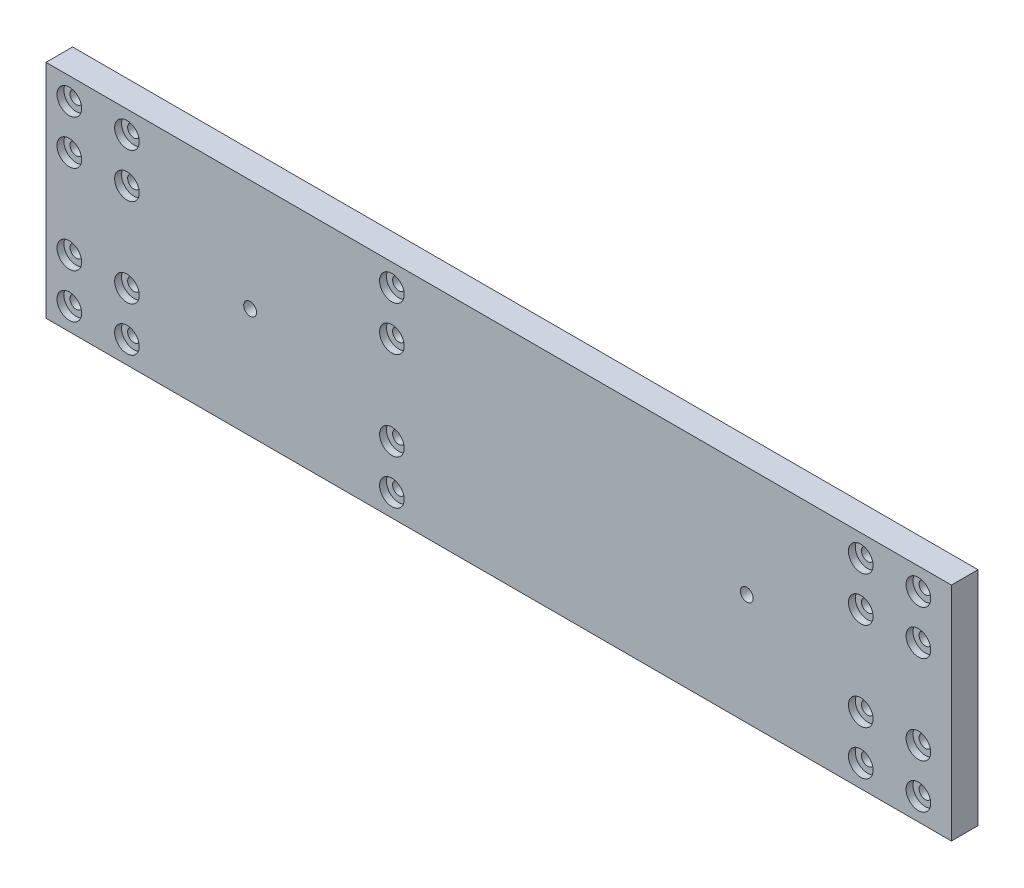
ISO-10303-21;
HEADER;
FILE_DESCRIPTION(('STEP AP214'),'2;1');
FILE_NAME('part.step','',(''),(''),'','','');
FILE_SCHEMA(('AUTOMOTIVE_DESIGN { 1 0 10303 214 1 1 1 1 }'));
ENDSEC;
DATA;
#1=APPLICATION_CONTEXT('core data for automotive mechanical design processes');
#2=APPLICATION_PROTOCOL_DEFINITION('international standard','automotive_design',2000,#1);
#3=PRODUCT_CONTEXT('',#1,'mechanical');
#4=PRODUCT('Part','Part','',(#3));
#5=PRODUCT_RELATED_PRODUCT_CATEGORY('part','',(#4));
#6=PRODUCT_DEFINITION_FORMATION('','',#4);
#7=PRODUCT_DEFINITION_CONTEXT('part definition',#1,'design');
#8=PRODUCT_DEFINITION('design','',#6,#7);
#9=PRODUCT_DEFINITION_SHAPE('','',#8);
#10=(LENGTH_UNIT() NAMED_UNIT(*) SI_UNIT(.MILLI.,.METRE.));
#11=(NAMED_UNIT(*) PLANE_ANGLE_UNIT() SI_UNIT($,.RADIAN.));
#12=(NAMED_UNIT(*) SI_UNIT($,.STERADIAN.) SOLID_ANGLE_UNIT());
#13=UNCERTAINTY_MEASURE_WITH_UNIT(LENGTH_MEASURE(1.E-05),#10,'distance_accuracy_value','');
#14=(GEOMETRIC_REPRESENTATION_CONTEXT(3) GLOBAL_UNCERTAINTY_ASSIGNED_CONTEXT((#13)) GLOBAL_UNIT_ASSIGNED_CONTEXT((#10,
#11,#12)) REPRESENTATION_CONTEXT('',''));
#15=CARTESIAN_POINT('',(0.,0.,0.));
#16=DIRECTION('',(0.,0.,1.));
#17=DIRECTION('',(1.,0.,0.));
#18=AXIS2_PLACEMENT_3D('',#15,#16,#17);
#19=CARTESIAN_POINT('',(-204.19949,-50.,12.));
#20=DIRECTION('',(0.,0.,1.));
#21=DIRECTION('',(1.,0.,0.));
#22=AXIS2_PLACEMENT_3D('',#19,#20,#21);
#23=PLANE('',#22);
#24=CARTESIAN_POINT('',(-112.12600576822,-0.273846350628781,12.));
#25=DIRECTION('',(0.,0.,-1.));
#26=DIRECTION('',(-1.,0.,0.));
#27=AXIS2_PLACEMENT_3D('',#24,#25,#26);
#28=CIRCLE('',#27,2.9);
#29=CARTESIAN_POINT('',(-115.02600576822,-0.273846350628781,12.));
#30=VERTEX_POINT('',#29);
#31=EDGE_CURVE('E360',#30,#30,#28,.T.);
#32=ORIENTED_EDGE('',*,*,#31,.T.);
#33=EDGE_LOOP('',(#32));
#34=FACE_BOUND('',#33,.T.);
#35=DIRECTION('',(0.,-1.,0.));
#36=VECTOR('',#35,1.);
#37=CARTESIAN_POINT('',(-204.19949,50.,12.));
#38=LINE('',#37,#36);
#39=CARTESIAN_POINT('',(-204.19949,50.,12.));
#40=VERTEX_POINT('',#39);
#41=CARTESIAN_POINT('',(-204.19949,-50.,12.));
#42=VERTEX_POINT('',#41);
#43=EDGE_CURVE('E82',#40,#42,#38,.T.);
#44=ORIENTED_EDGE('',*,*,#43,.T.);
#45=DIRECTION('',(1.,0.,0.));
#46=VECTOR('',#45,1.);
#47=CARTESIAN_POINT('',(-204.19949,-50.,12.));
#48=LINE('',#47,#46);
#49=CARTESIAN_POINT('',(204.19949,-50.,12.));
#50=VERTEX_POINT('',#49);
#51=EDGE_CURVE('E77',#42,#50,#48,.T.);
#52=ORIENTED_EDGE('',*,*,#51,.T.);
#53=DIRECTION('',(0.,1.,0.));
#54=VECTOR('',#53,1.);
#55=CARTESIAN_POINT('',(204.19949,50.,12.));
#56=LINE('',#55,#54);
#57=CARTESIAN_POINT('',(204.19949,50.,12.));
#58=VERTEX_POINT('',#57);
#59=EDGE_CURVE('E80',#50,#58,#56,.T.);
#60=ORIENTED_EDGE('',*,*,#59,.T.);
#61=DIRECTION('',(-1.,0.,0.));
#62=VECTOR('',#61,1.);
#63=CARTESIAN_POINT('',(-204.19949,50.,12.));
#64=LINE('',#63,#62);
#65=EDGE_CURVE('E47',#58,#40,#64,.T.);
#66=ORIENTED_EDGE('',*,*,#65,.T.);
#67=EDGE_LOOP('',(#44,#52,#60,#66));
#68=FACE_BOUND('',#67,.T.);
#69=CARTESIAN_POINT('',(-193.6908,-20.,12.));
#70=DIRECTION('',(0.,0.,1.));
#71=DIRECTION('',(1.,0.,0.));
#72=AXIS2_PLACEMENT_3D('',#69,#70,#71);
#73=CIRCLE('',#72,5.55625000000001);
#74=CARTESIAN_POINT('',(-188.13455,-20.,12.));
#75=VERTEX_POINT('',#74);
#76=EDGE_CURVE('E117',#75,#75,#73,.T.);
#77=ORIENTED_EDGE('',*,*,#76,.F.);
#78=EDGE_LOOP('',(#77));
#79=FACE_BOUND('',#78,.T.);
#80=CARTESIAN_POINT('',(-167.6908,-20.,12.));
#81=DIRECTION('',(0.,0.,1.));
#82=DIRECTION('',(1.,0.,0.));
#83=AXIS2_PLACEMENT_3D('',#80,#81,#82);
#84=CIRCLE('',#83,5.55625000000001);
#85=CARTESIAN_POINT('',(-162.13455,-20.,12.));
#86=VERTEX_POINT('',#85);
#87=EDGE_CURVE('E129',#86,#86,#84,.T.);
#88=ORIENTED_EDGE('',*,*,#87,.F.);
#89=EDGE_LOOP('',(#88));
#90=FACE_BOUND('',#89,.T.);
#91=CARTESIAN_POINT('',(-193.6908,-40.,12.));
#92=DIRECTION('',(0.,0.,1.));
#93=DIRECTION('',(1.,0.,0.));
#94=AXIS2_PLACEMENT_3D('',#91,#92,#93);
#95=CIRCLE('',#94,5.55625000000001);
#96=CARTESIAN_POINT('',(-188.13455,-40.,12.));
#97=VERTEX_POINT('',#96);
#98=EDGE_CURVE('E141',#97,#97,#95,.T.);
#99=ORIENTED_EDGE('',*,*,#98,.F.);
#100=EDGE_LOOP('',(#99));
#101=FACE_BOUND('',#100,.T.);
#102=CARTESIAN_POINT('',(163.30874,-40.,12.));
#103=DIRECTION('',(0.,0.,1.));
#104=DIRECTION('',(1.,0.,0.));
#105=AXIS2_PLACEMENT_3D('',#102,#103,#104);
#106=CIRCLE('',#105,5.55625000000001);
#107=CARTESIAN_POINT('',(168.86499,-40.,12.));
#108=VERTEX_POINT('',#107);
#109=EDGE_CURVE('E153',#108,#108,#106,.T.);
#110=ORIENTED_EDGE('',*,*,#109,.F.);
#111=EDGE_LOOP('',(#110));
#112=FACE_BOUND('',#111,.T.);
#113=CARTESIAN_POINT('',(189.30874,-40.,12.));
#114=DIRECTION('',(0.,0.,1.));
#115=DIRECTION('',(1.,0.,0.));
#116=AXIS2_PLACEMENT_3D('',#113,#114,#115);
#117=CIRCLE('',#116,5.55625000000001);
#118=CARTESIAN_POINT('',(194.86499,-40.,12.));
#119=VERTEX_POINT('',#118);
#120=EDGE_CURVE('E165',#119,#119,#117,.T.);
#121=ORIENTED_EDGE('',*,*,#120,.F.);
#122=EDGE_LOOP('',(#121));
#123=FACE_BOUND('',#122,.T.);
#124=CARTESIAN_POINT('',(189.30874,-20.,12.));
#125=DIRECTION('',(0.,0.,1.));
#126=DIRECTION('',(1.,0.,0.));
#127=AXIS2_PLACEMENT_3D('',#124,#125,#126);
#128=CIRCLE('',#127,5.55625000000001);
#129=CARTESIAN_POINT('',(194.86499,-20.,12.));
#130=VERTEX_POINT('',#129);
#131=EDGE_CURVE('E177',#130,#130,#128,.T.);
#132=ORIENTED_EDGE('',*,*,#131,.F.);
#133=EDGE_LOOP('',(#132));
#134=FACE_BOUND('',#133,.T.);
#135=CARTESIAN_POINT('',(163.30874,-20.,12.));
#136=DIRECTION('',(0.,0.,1.));
#137=DIRECTION('',(1.,0.,0.));
#138=AXIS2_PLACEMENT_3D('',#135,#136,#137);
#139=CIRCLE('',#138,5.55625000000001);
#140=CARTESIAN_POINT('',(168.86499,-20.,12.));
#141=VERTEX_POINT('',#140);
#142=EDGE_CURVE('E189',#141,#141,#139,.T.);
#143=ORIENTED_EDGE('',*,*,#142,.F.);
#144=EDGE_LOOP('',(#143));
#145=FACE_BOUND('',#144,.T.);
#146=CARTESIAN_POINT('',(163.30874,20.,12.));
#147=DIRECTION('',(0.,0.,1.));
#148=DIRECTION('',(1.,0.,0.));
#149=AXIS2_PLACEMENT_3D('',#146,#147,#148);
#150=CIRCLE('',#149,5.55625000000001);
#151=CARTESIAN_POINT('',(168.86499,20.,12.));
#152=VERTEX_POINT('',#151);
#153=EDGE_CURVE('E201',#152,#152,#150,.T.);
#154=ORIENTED_EDGE('',*,*,#153,.F.);
#155=EDGE_LOOP('',(#154));
#156=FACE_BOUND('',#155,.T.);
#157=CARTESIAN_POINT('',(189.30874,20.,12.));
#158=DIRECTION('',(0.,0.,1.));
#159=DIRECTION('',(1.,0.,0.));
#160=AXIS2_PLACEMENT_3D('',#157,#158,#159);
#161=CIRCLE('',#160,5.55625000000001);
#162=CARTESIAN_POINT('',(194.86499,20.,12.));
#163=VERTEX_POINT('',#162);
#164=EDGE_CURVE('E213',#163,#163,#161,.T.);
#165=ORIENTED_EDGE('',*,*,#164,.F.);
#166=EDGE_LOOP('',(#165));
#167=FACE_BOUND('',#166,.T.);
#168=CARTESIAN_POINT('',(189.30874,40.,12.));
#169=DIRECTION('',(0.,0.,1.));
#170=DIRECTION('',(1.,0.,0.));
#171=AXIS2_PLACEMENT_3D('',#168,#169,#170);
#172=CIRCLE('',#171,5.55625000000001);
#173=CARTESIAN_POINT('',(194.86499,40.,12.));
#174=VERTEX_POINT('',#173);
#175=EDGE_CURVE('E225',#174,#174,#172,.T.);
#176=ORIENTED_EDGE('',*,*,#175,.F.);
#177=EDGE_LOOP('',(#176));
#178=FACE_BOUND('',#177,.T.);
#179=CARTESIAN_POINT('',(163.30874,40.,12.));
#180=DIRECTION('',(0.,0.,1.));
#181=DIRECTION('',(1.,0.,0.));
#182=AXIS2_PLACEMENT_3D('',#179,#180,#181);
#183=CIRCLE('',#182,5.55625000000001);
#184=CARTESIAN_POINT('',(168.86499,40.,12.));
#185=VERTEX_POINT('',#184);
#186=EDGE_CURVE('E237',#185,#185,#183,.T.);
#187=ORIENTED_EDGE('',*,*,#186,.F.);
#188=EDGE_LOOP('',(#187));
#189=FACE_BOUND('',#188,.T.);
#190=CARTESIAN_POINT('',(-48.18056,-40.,12.));
#191=DIRECTION('',(0.,0.,1.));
#192=DIRECTION('',(1.,0.,0.));
#193=AXIS2_PLACEMENT_3D('',#190,#191,#192);
#194=CIRCLE('',#193,5.55625);
#195=CARTESIAN_POINT('',(-42.62431,-40.,12.));
#196=VERTEX_POINT('',#195);
#197=EDGE_CURVE('E249',#196,#196,#194,.T.);
#198=ORIENTED_EDGE('',*,*,#197,.F.);
#199=EDGE_LOOP('',(#198));
#200=FACE_BOUND('',#199,.T.);
#201=CARTESIAN_POINT('',(-48.18056,-20.,12.));
#202=DIRECTION('',(0.,0.,1.));
#203=DIRECTION('',(1.,0.,0.));
#204=AXIS2_PLACEMENT_3D('',#201,#202,#203);
#205=CIRCLE('',#204,5.55625);
#206=CARTESIAN_POINT('',(-42.62431,-20.,12.));
#207=VERTEX_POINT('',#206);
#208=EDGE_CURVE('E261',#207,#207,#205,.T.);
#209=ORIENTED_EDGE('',*,*,#208,.F.);
#210=EDGE_LOOP('',(#209));
#211=FACE_BOUND('',#210,.T.);
#212=CARTESIAN_POINT('',(-48.18056,20.,12.));
#213=DIRECTION('',(0.,0.,1.));
#214=DIRECTION('',(1.,0.,0.));
#215=AXIS2_PLACEMENT_3D('',#212,#213,#214);
#216=CIRCLE('',#215,5.55625);
#217=CARTESIAN_POINT('',(-42.62431,20.,12.));
#218=VERTEX_POINT('',#217);
#219=EDGE_CURVE('E273',#218,#218,#216,.T.);
#220=ORIENTED_EDGE('',*,*,#219,.F.);
#221=EDGE_LOOP('',(#220));
#222=FACE_BOUND('',#221,.T.);
#223=CARTESIAN_POINT('',(-48.18056,40.,12.));
#224=DIRECTION('',(0.,0.,1.));
#225=DIRECTION('',(1.,0.,0.));
#226=AXIS2_PLACEMENT_3D('',#223,#224,#225);
#227=CIRCLE('',#226,5.55625);
#228=CARTESIAN_POINT('',(-42.62431,40.,12.));
#229=VERTEX_POINT('',#228);
#230=EDGE_CURVE('E285',#229,#229,#227,.T.);
#231=ORIENTED_EDGE('',*,*,#230,.F.);
#232=EDGE_LOOP('',(#231));
#233=FACE_BOUND('',#232,.T.);
#234=CARTESIAN_POINT('',(-167.6908,-40.,12.));
#235=DIRECTION('',(0.,0.,1.));
#236=DIRECTION('',(1.,0.,0.));
#237=AXIS2_PLACEMENT_3D('',#234,#235,#236);
#238=CIRCLE('',#237,5.55625000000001);
#239=CARTESIAN_POINT('',(-162.13455,-40.,12.));
#240=VERTEX_POINT('',#239);
#241=EDGE_CURVE('E297',#240,#240,#238,.T.);
#242=ORIENTED_EDGE('',*,*,#241,.F.);
#243=EDGE_LOOP('',(#242));
#244=FACE_BOUND('',#243,.T.);
#245=CARTESIAN_POINT('',(-193.6908,20.,12.));
#246=DIRECTION('',(0.,0.,1.));
#247=DIRECTION('',(1.,0.,0.));
#248=AXIS2_PLACEMENT_3D('',#245,#246,#247);
#249=CIRCLE('',#248,5.55625000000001);
#250=CARTESIAN_POINT('',(-188.13455,20.,12.));
#251=VERTEX_POINT('',#250);
#252=EDGE_CURVE('E309',#251,#251,#249,.T.);
#253=ORIENTED_EDGE('',*,*,#252,.F.);
#254=EDGE_LOOP('',(#253));
#255=FACE_BOUND('',#254,.T.);
#256=CARTESIAN_POINT('',(-167.6908,20.,12.));
#257=DIRECTION('',(0.,0.,1.));
#258=DIRECTION('',(1.,0.,0.));
#259=AXIS2_PLACEMENT_3D('',#256,#257,#258);
#260=CIRCLE('',#259,5.55625000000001);
#261=CARTESIAN_POINT('',(-162.13455,20.,12.));
#262=VERTEX_POINT('',#261);
#263=EDGE_CURVE('E321',#262,#262,#260,.T.);
#264=ORIENTED_EDGE('',*,*,#263,.F.);
#265=EDGE_LOOP('',(#264));
#266=FACE_BOUND('',#265,.T.);
#267=CARTESIAN_POINT('',(-167.6908,40.,12.));
#268=DIRECTION('',(0.,0.,1.));
#269=DIRECTION('',(1.,0.,0.));
#270=AXIS2_PLACEMENT_3D('',#267,#268,#269);
#271=CIRCLE('',#270,5.55625000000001);
#272=CARTESIAN_POINT('',(-162.13455,40.,12.));
#273=VERTEX_POINT('',#272);
#274=EDGE_CURVE('E333',#273,#273,#271,.T.);
#275=ORIENTED_EDGE('',*,*,#274,.F.);
#276=EDGE_LOOP('',(#275));
#277=FACE_BOUND('',#276,.T.);
#278=CARTESIAN_POINT('',(-193.6908,40.,12.));
#279=DIRECTION('',(0.,0.,1.));
#280=DIRECTION('',(1.,0.,0.));
#281=AXIS2_PLACEMENT_3D('',#278,#279,#280);
#282=CIRCLE('',#281,5.55625000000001);
#283=CARTESIAN_POINT('',(-188.13455,40.,12.));
#284=VERTEX_POINT('',#283);
#285=EDGE_CURVE('E345',#284,#284,#282,.T.);
#286=ORIENTED_EDGE('',*,*,#285,.F.);
#287=EDGE_LOOP('',(#286));
#288=FACE_BOUND('',#287,.T.);
#289=CARTESIAN_POINT('',(111.904730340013,0.0982977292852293,12.));
#290=DIRECTION('',(0.,0.,-1.));
#291=DIRECTION('',(-1.,0.,0.));
#292=AXIS2_PLACEMENT_3D('',#289,#290,#291);
#293=CIRCLE('',#292,2.9);
#294=CARTESIAN_POINT('',(109.004730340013,0.0982977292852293,12.));
#295=VERTEX_POINT('',#294);
#296=EDGE_CURVE('E348',#295,#295,#293,.T.);
#297=ORIENTED_EDGE('',*,*,#296,.T.);
#298=EDGE_LOOP('',(#297));
#299=FACE_BOUND('',#298,.T.);
#300=ADVANCED_FACE('F30',(#34,#68,#79,#90,#101,#112,#123,#134,#145,#156,#167,#178,#189,#200,
#211,#222,#233,#244,#255,#266,#277,#288,#299),#23,.T.);
#301=CARTESIAN_POINT('',(-204.19949,-50.,0.));
#302=DIRECTION('',(0.,0.,1.));
#303=DIRECTION('',(1.,0.,0.));
#304=AXIS2_PLACEMENT_3D('',#301,#302,#303);
#305=PLANE('',#304);
#306=CARTESIAN_POINT('',(-112.12600576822,-0.273846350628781,0.));
#307=DIRECTION('',(0.,0.,-1.));
#308=DIRECTION('',(-1.,0.,0.));
#309=AXIS2_PLACEMENT_3D('',#306,#307,#308);
#310=CIRCLE('',#309,6.12);
#311=CARTESIAN_POINT('',(-118.24600576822,-0.273846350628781,0.));
#312=VERTEX_POINT('',#311);
#313=EDGE_CURVE('E369',#312,#312,#310,.T.);
#314=ORIENTED_EDGE('',*,*,#313,.F.);
#315=EDGE_LOOP('',(#314));
#316=FACE_BOUND('',#315,.T.);
#317=DIRECTION('',(0.,-1.,0.));
#318=VECTOR('',#317,1.);
#319=CARTESIAN_POINT('',(-204.19949,50.,0.));
#320=LINE('',#319,#318);
#321=CARTESIAN_POINT('',(-204.19949,50.,0.));
#322=VERTEX_POINT('',#321);
#323=CARTESIAN_POINT('',(-204.19949,-50.,0.));
#324=VERTEX_POINT('',#323);
#325=EDGE_CURVE('E94',#322,#324,#320,.T.);
#326=ORIENTED_EDGE('',*,*,#325,.F.);
#327=DIRECTION('',(-1.,0.,0.));
#328=VECTOR('',#327,1.);
#329=CARTESIAN_POINT('',(-204.19949,50.,0.));
#330=LINE('',#329,#328);
#331=CARTESIAN_POINT('',(204.19949,50.,0.));
#332=VERTEX_POINT('',#331);
#333=EDGE_CURVE('E70',#332,#322,#330,.T.);
#334=ORIENTED_EDGE('',*,*,#333,.F.);
#335=DIRECTION('',(0.,1.,0.));
#336=VECTOR('',#335,1.);
#337=CARTESIAN_POINT('',(204.19949,50.,0.));
#338=LINE('',#337,#336);
#339=CARTESIAN_POINT('',(204.19949,-50.,0.));
#340=VERTEX_POINT('',#339);
#341=EDGE_CURVE('E64',#340,#332,#338,.T.);
#342=ORIENTED_EDGE('',*,*,#341,.F.);
#343=DIRECTION('',(1.,0.,0.));
#344=VECTOR('',#343,1.);
#345=CARTESIAN_POINT('',(-204.19949,-50.,0.));
#346=LINE('',#345,#344);
#347=EDGE_CURVE('E86',#324,#340,#346,.T.);
#348=ORIENTED_EDGE('',*,*,#347,.F.);
#349=EDGE_LOOP('',(#326,#334,#342,#348));
#350=FACE_BOUND('',#349,.T.);
#351=CARTESIAN_POINT('',(-193.6908,-20.,0.));
#352=DIRECTION('',(0.,0.,1.));
#353=DIRECTION('',(1.,0.,0.));
#354=AXIS2_PLACEMENT_3D('',#351,#352,#353);
#355=CIRCLE('',#354,2.8067);
#356=CARTESIAN_POINT('',(-190.8841,-20.,0.));
#357=VERTEX_POINT('',#356);
#358=EDGE_CURVE('E97',#357,#357,#355,.T.);
#359=ORIENTED_EDGE('',*,*,#358,.T.);
#360=EDGE_LOOP('',(#359));
#361=FACE_BOUND('',#360,.T.);
#362=CARTESIAN_POINT('',(-167.6908,-20.,0.));
#363=DIRECTION('',(0.,0.,1.));
#364=DIRECTION('',(1.,0.,0.));
#365=AXIS2_PLACEMENT_3D('',#362,#363,#364);
#366=CIRCLE('',#365,2.8067);
#367=CARTESIAN_POINT('',(-164.8841,-20.,0.));
#368=VERTEX_POINT('',#367);
#369=EDGE_CURVE('E120',#368,#368,#366,.T.);
#370=ORIENTED_EDGE('',*,*,#369,.T.);
#371=EDGE_LOOP('',(#370));
#372=FACE_BOUND('',#371,.T.);
#373=CARTESIAN_POINT('',(-193.6908,-40.,0.));
#374=DIRECTION('',(0.,0.,1.));
#375=DIRECTION('',(1.,0.,0.));
#376=AXIS2_PLACEMENT_3D('',#373,#374,#375);
#377=CIRCLE('',#376,2.8067);
#378=CARTESIAN_POINT('',(-190.8841,-40.,0.));
#379=VERTEX_POINT('',#378);
#380=EDGE_CURVE('E132',#379,#379,#377,.T.);
#381=ORIENTED_EDGE('',*,*,#380,.T.);
#382=EDGE_LOOP('',(#381));
#383=FACE_BOUND('',#382,.T.);
#384=CARTESIAN_POINT('',(163.30874,-40.,0.));
#385=DIRECTION('',(0.,0.,1.));
#386=DIRECTION('',(1.,0.,0.));
#387=AXIS2_PLACEMENT_3D('',#384,#385,#386);
#388=CIRCLE('',#387,2.8067);
#389=CARTESIAN_POINT('',(166.11544,-40.,0.));
#390=VERTEX_POINT('',#389);
#391=EDGE_CURVE('E144',#390,#390,#388,.T.);
#392=ORIENTED_EDGE('',*,*,#391,.T.);
#393=EDGE_LOOP('',(#392));
#394=FACE_BOUND('',#393,.T.);
#395=CARTESIAN_POINT('',(189.30874,-40.,0.));
#396=DIRECTION('',(0.,0.,1.));
#397=DIRECTION('',(1.,0.,0.));
#398=AXIS2_PLACEMENT_3D('',#395,#396,#397);
#399=CIRCLE('',#398,2.8067);
#400=CARTESIAN_POINT('',(192.11544,-40.,0.));
#401=VERTEX_POINT('',#400);
#402=EDGE_CURVE('E156',#401,#401,#399,.T.);
#403=ORIENTED_EDGE('',*,*,#402,.T.);
#404=EDGE_LOOP('',(#403));
#405=FACE_BOUND('',#404,.T.);
#406=CARTESIAN_POINT('',(189.30874,-20.,0.));
#407=DIRECTION('',(0.,0.,1.));
#408=DIRECTION('',(1.,0.,0.));
#409=AXIS2_PLACEMENT_3D('',#406,#407,#408);
#410=CIRCLE('',#409,2.8067);
#411=CARTESIAN_POINT('',(192.11544,-20.,0.));
#412=VERTEX_POINT('',#411);
#413=EDGE_CURVE('E168',#412,#412,#410,.T.);
#414=ORIENTED_EDGE('',*,*,#413,.T.);
#415=EDGE_LOOP('',(#414));
#416=FACE_BOUND('',#415,.T.);
#417=CARTESIAN_POINT('',(163.30874,-20.,0.));
#418=DIRECTION('',(0.,0.,1.));
#419=DIRECTION('',(1.,0.,0.));
#420=AXIS2_PLACEMENT_3D('',#417,#418,#419);
#421=CIRCLE('',#420,2.8067);
#422=CARTESIAN_POINT('',(166.11544,-20.,0.));
#423=VERTEX_POINT('',#422);
#424=EDGE_CURVE('E180',#423,#423,#421,.T.);
#425=ORIENTED_EDGE('',*,*,#424,.T.);
#426=EDGE_LOOP('',(#425));
#427=FACE_BOUND('',#426,.T.);
#428=CARTESIAN_POINT('',(163.30874,20.,0.));
#429=DIRECTION('',(0.,0.,1.));
#430=DIRECTION('',(1.,0.,0.));
#431=AXIS2_PLACEMENT_3D('',#428,#429,#430);
#432=CIRCLE('',#431,2.8067);
#433=CARTESIAN_POINT('',(166.11544,20.,0.));
#434=VERTEX_POINT('',#433);
#435=EDGE_CURVE('E192',#434,#434,#432,.T.);
#436=ORIENTED_EDGE('',*,*,#435,.T.);
#437=EDGE_LOOP('',(#436));
#438=FACE_BOUND('',#437,.T.);
#439=CARTESIAN_POINT('',(189.30874,20.,0.));
#440=DIRECTION('',(0.,0.,1.));
#441=DIRECTION('',(1.,0.,0.));
#442=AXIS2_PLACEMENT_3D('',#439,#440,#441);
#443=CIRCLE('',#442,2.8067);
#444=CARTESIAN_POINT('',(192.11544,20.,0.));
#445=VERTEX_POINT('',#444);
#446=EDGE_CURVE('E204',#445,#445,#443,.T.);
#447=ORIENTED_EDGE('',*,*,#446,.T.);
#448=EDGE_LOOP('',(#447));
#449=FACE_BOUND('',#448,.T.);
#450=CARTESIAN_POINT('',(189.30874,40.,0.));
#451=DIRECTION('',(0.,0.,1.));
#452=DIRECTION('',(1.,0.,0.));
#453=AXIS2_PLACEMENT_3D('',#450,#451,#452);
#454=CIRCLE('',#453,2.8067);
#455=CARTESIAN_POINT('',(192.11544,40.,0.));
#456=VERTEX_POINT('',#455);
#457=EDGE_CURVE('E216',#456,#456,#454,.T.);
#458=ORIENTED_EDGE('',*,*,#457,.T.);
#459=EDGE_LOOP('',(#458));
#460=FACE_BOUND('',#459,.T.);
#461=CARTESIAN_POINT('',(163.30874,40.,0.));
#462=DIRECTION('',(0.,0.,1.));
#463=DIRECTION('',(1.,0.,0.));
#464=AXIS2_PLACEMENT_3D('',#461,#462,#463);
#465=CIRCLE('',#464,2.8067);
#466=CARTESIAN_POINT('',(166.11544,40.,0.));
#467=VERTEX_POINT('',#466);
#468=EDGE_CURVE('E228',#467,#467,#465,.T.);
#469=ORIENTED_EDGE('',*,*,#468,.T.);
#470=EDGE_LOOP('',(#469));
#471=FACE_BOUND('',#470,.T.);
#472=CARTESIAN_POINT('',(-48.18056,-40.,0.));
#473=DIRECTION('',(0.,0.,1.));
#474=DIRECTION('',(1.,0.,0.));
#475=AXIS2_PLACEMENT_3D('',#472,#473,#474);
#476=CIRCLE('',#475,2.8067);
#477=CARTESIAN_POINT('',(-45.37386,-40.,0.));
#478=VERTEX_POINT('',#477);
#479=EDGE_CURVE('E240',#478,#478,#476,.T.);
#480=ORIENTED_EDGE('',*,*,#479,.T.);
#481=EDGE_LOOP('',(#480));
#482=FACE_BOUND('',#481,.T.);
#483=CARTESIAN_POINT('',(-48.18056,-20.,0.));
#484=DIRECTION('',(0.,0.,1.));
#485=DIRECTION('',(1.,0.,0.));
#486=AXIS2_PLACEMENT_3D('',#483,#484,#485);
#487=CIRCLE('',#486,2.8067);
#488=CARTESIAN_POINT('',(-45.37386,-20.,0.));
#489=VERTEX_POINT('',#488);
#490=EDGE_CURVE('E252',#489,#489,#487,.T.);
#491=ORIENTED_EDGE('',*,*,#490,.T.);
#492=EDGE_LOOP('',(#491));
#493=FACE_BOUND('',#492,.T.);
#494=CARTESIAN_POINT('',(-48.18056,20.,0.));
#495=DIRECTION('',(0.,0.,1.));
#496=DIRECTION('',(1.,0.,0.));
#497=AXIS2_PLACEMENT_3D('',#494,#495,#496);
#498=CIRCLE('',#497,2.8067);
#499=CARTESIAN_POINT('',(-45.37386,20.,0.));
#500=VERTEX_POINT('',#499);
#501=EDGE_CURVE('E264',#500,#500,#498,.T.);
#502=ORIENTED_EDGE('',*,*,#501,.T.);
#503=EDGE_LOOP('',(#502));
#504=FACE_BOUND('',#503,.T.);
#505=CARTESIAN_POINT('',(-48.18056,40.,0.));
#506=DIRECTION('',(0.,0.,1.));
#507=DIRECTION('',(1.,0.,0.));
#508=AXIS2_PLACEMENT_3D('',#505,#506,#507);
#509=CIRCLE('',#508,2.8067);
#510=CARTESIAN_POINT('',(-45.37386,40.,0.));
#511=VERTEX_POINT('',#510);
#512=EDGE_CURVE('E276',#511,#511,#509,.T.);
#513=ORIENTED_EDGE('',*,*,#512,.T.);
#514=EDGE_LOOP('',(#513));
#515=FACE_BOUND('',#514,.T.);
#516=CARTESIAN_POINT('',(-167.6908,-40.,0.));
#517=DIRECTION('',(0.,0.,1.));
#518=DIRECTION('',(1.,0.,0.));
#519=AXIS2_PLACEMENT_3D('',#516,#517,#518);
#520=CIRCLE('',#519,2.8067);
#521=CARTESIAN_POINT('',(-164.8841,-40.,0.));
#522=VERTEX_POINT('',#521);
#523=EDGE_CURVE('E288',#522,#522,#520,.T.);
#524=ORIENTED_EDGE('',*,*,#523,.T.);
#525=EDGE_LOOP('',(#524));
#526=FACE_BOUND('',#525,.T.);
#527=CARTESIAN_POINT('',(-193.6908,20.,0.));
#528=DIRECTION('',(0.,0.,1.));
#529=DIRECTION('',(1.,0.,0.));
#530=AXIS2_PLACEMENT_3D('',#527,#528,#529);
#531=CIRCLE('',#530,2.8067);
#532=CARTESIAN_POINT('',(-190.8841,20.,0.));
#533=VERTEX_POINT('',#532);
#534=EDGE_CURVE('E300',#533,#533,#531,.T.);
#535=ORIENTED_EDGE('',*,*,#534,.T.);
#536=EDGE_LOOP('',(#535));
#537=FACE_BOUND('',#536,.T.);
#538=CARTESIAN_POINT('',(-167.6908,20.,0.));
#539=DIRECTION('',(0.,0.,1.));
#540=DIRECTION('',(1.,0.,0.));
#541=AXIS2_PLACEMENT_3D('',#538,#539,#540);
#542=CIRCLE('',#541,2.8067);
#543=CARTESIAN_POINT('',(-164.8841,20.,0.));
#544=VERTEX_POINT('',#543);
#545=EDGE_CURVE('E312',#544,#544,#542,.T.);
#546=ORIENTED_EDGE('',*,*,#545,.T.);
#547=EDGE_LOOP('',(#546));
#548=FACE_BOUND('',#547,.T.);
#549=CARTESIAN_POINT('',(-167.6908,40.,0.));
#550=DIRECTION('',(0.,0.,1.));
#551=DIRECTION('',(1.,0.,0.));
#552=AXIS2_PLACEMENT_3D('',#549,#550,#551);
#553=CIRCLE('',#552,2.8067);
#554=CARTESIAN_POINT('',(-164.8841,40.,0.));
#555=VERTEX_POINT('',#554);
#556=EDGE_CURVE('E324',#555,#555,#553,.T.);
#557=ORIENTED_EDGE('',*,*,#556,.T.);
#558=EDGE_LOOP('',(#557));
#559=FACE_BOUND('',#558,.T.);
#560=CARTESIAN_POINT('',(-193.6908,40.,0.));
#561=DIRECTION('',(0.,0.,1.));
#562=DIRECTION('',(1.,0.,0.));
#563=AXIS2_PLACEMENT_3D('',#560,#561,#562);
#564=CIRCLE('',#563,2.8067);
#565=CARTESIAN_POINT('',(-190.8841,40.,0.));
#566=VERTEX_POINT('',#565);
#567=EDGE_CURVE('E336',#566,#566,#564,.T.);
#568=ORIENTED_EDGE('',*,*,#567,.T.);
#569=EDGE_LOOP('',(#568));
#570=FACE_BOUND('',#569,.T.);
#571=CARTESIAN_POINT('',(111.904730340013,0.0982977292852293,0.));
#572=DIRECTION('',(0.,0.,-1.));
#573=DIRECTION('',(-1.,0.,0.));
#574=AXIS2_PLACEMENT_3D('',#571,#572,#573);
#575=CIRCLE('',#574,6.12);
#576=CARTESIAN_POINT('',(105.784730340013,0.0982977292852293,0.));
#577=VERTEX_POINT('',#576);
#578=EDGE_CURVE('E357',#577,#577,#575,.T.);
#579=ORIENTED_EDGE('',*,*,#578,.F.);
#580=EDGE_LOOP('',(#579));
#581=FACE_BOUND('',#580,.T.);
#582=ADVANCED_FACE('F105',(#316,#350,#361,#372,#383,#394,#405,#416,#427,#438,#449,#460,#471,
#482,#493,#504,#515,#526,#537,#548,#559,#570,#581),#305,.F.);
#583=CARTESIAN_POINT('',(-204.19949,50.,12.));
#584=DIRECTION('',(1.,0.,0.));
#585=DIRECTION('',(0.,1.,0.));
#586=AXIS2_PLACEMENT_3D('',#583,#584,#585);
#587=PLANE('',#586);
#588=ORIENTED_EDGE('',*,*,#325,.T.);
#589=DIRECTION('',(0.,0.,-1.));
#590=VECTOR('',#589,1.);
#591=CARTESIAN_POINT('',(-204.19949,-50.,12.));
#592=LINE('',#591,#590);
#593=EDGE_CURVE('E11',#42,#324,#592,.T.);
#594=ORIENTED_EDGE('',*,*,#593,.F.);
#595=ORIENTED_EDGE('',*,*,#43,.F.);
#596=DIRECTION('',(0.,0.,-1.));
#597=VECTOR('',#596,1.);
#598=CARTESIAN_POINT('',(-204.19949,50.,12.));
#599=LINE('',#598,#597);
#600=EDGE_CURVE('E90',#40,#322,#599,.T.);
#601=ORIENTED_EDGE('',*,*,#600,.T.);
#602=EDGE_LOOP('',(#588,#594,#595,#601));
#603=FACE_BOUND('',#602,.T.);
#604=ADVANCED_FACE('F32',(#603),#587,.F.);
#605=CARTESIAN_POINT('',(-204.19949,-50.,12.));
#606=DIRECTION('',(0.,1.,0.));
#607=DIRECTION('',(-1.,0.,0.));
#608=AXIS2_PLACEMENT_3D('',#605,#606,#607);
#609=PLANE('',#608);
#610=ORIENTED_EDGE('',*,*,#347,.T.);
#611=DIRECTION('',(0.,0.,-1.));
#612=VECTOR('',#611,1.);
#613=CARTESIAN_POINT('',(204.19949,-50.,12.));
#614=LINE('',#613,#612);
#615=EDGE_CURVE('E39',#50,#340,#614,.T.);
#616=ORIENTED_EDGE('',*,*,#615,.F.);
#617=ORIENTED_EDGE('',*,*,#51,.F.);
#618=ORIENTED_EDGE('',*,*,#593,.T.);
#619=EDGE_LOOP('',(#610,#616,#617,#618));
#620=FACE_BOUND('',#619,.T.);
#621=ADVANCED_FACE('F85',(#620),#609,.F.);
#622=CARTESIAN_POINT('',(204.19949,50.,12.));
#623=DIRECTION('',(-1.,0.,0.));
#624=DIRECTION('',(0.,0.,1.));
#625=AXIS2_PLACEMENT_3D('',#622,#623,#624);
#626=PLANE('',#625);
#627=ORIENTED_EDGE('',*,*,#341,.T.);
#628=DIRECTION('',(0.,0.,-1.));
#629=VECTOR('',#628,1.);
#630=CARTESIAN_POINT('',(204.19949,50.,12.));
#631=LINE('',#630,#629);
#632=EDGE_CURVE('E87',#58,#332,#631,.T.);
#633=ORIENTED_EDGE('',*,*,#632,.F.);
#634=ORIENTED_EDGE('',*,*,#59,.F.);
#635=ORIENTED_EDGE('',*,*,#615,.T.);
#636=EDGE_LOOP('',(#627,#633,#634,#635));
#637=FACE_BOUND('',#636,.T.);
#638=ADVANCED_FACE('F88',(#637),#626,.F.);
#639=CARTESIAN_POINT('',(-204.19949,50.,12.));
#640=DIRECTION('',(0.,-1.,0.));
#641=DIRECTION('',(1.,0.,0.));
#642=AXIS2_PLACEMENT_3D('',#639,#640,#641);
#643=PLANE('',#642);
#644=ORIENTED_EDGE('',*,*,#333,.T.);
#645=ORIENTED_EDGE('',*,*,#600,.F.);
#646=ORIENTED_EDGE('',*,*,#65,.F.);
#647=ORIENTED_EDGE('',*,*,#632,.T.);
#648=EDGE_LOOP('',(#644,#645,#646,#647));
#649=FACE_BOUND('',#648,.T.);
#650=ADVANCED_FACE('F102',(#649),#643,.F.);
#651=CARTESIAN_POINT('',(-193.6908,-20.,12.));
#652=DIRECTION('',(0.,0.,1.));
#653=DIRECTION('',(1.,0.,0.));
#654=AXIS2_PLACEMENT_3D('',#651,#652,#653);
#655=CYLINDRICAL_SURFACE('',#654,2.8067);
#656=ORIENTED_EDGE('',*,*,#358,.F.);
#657=EDGE_LOOP('',(#656));
#658=FACE_BOUND('',#657,.T.);
#659=CARTESIAN_POINT('',(-193.6908,-20.,8.8758));
#660=DIRECTION('',(0.,0.,1.));
#661=DIRECTION('',(1.,0.,0.));
#662=AXIS2_PLACEMENT_3D('',#659,#660,#661);
#663=CIRCLE('',#662,2.8067);
#664=CARTESIAN_POINT('',(-190.8841,-20.,8.8758));
#665=VERTEX_POINT('',#664);
#666=EDGE_CURVE('E111',#665,#665,#663,.T.);
#667=ORIENTED_EDGE('',*,*,#666,.T.);
#668=EDGE_LOOP('',(#667));
#669=FACE_BOUND('',#668,.T.);
#670=ADVANCED_FACE('F387',(#658,#669),#655,.F.);
#671=CARTESIAN_POINT('',(-190.8841,-20.,8.8758));
#672=DIRECTION('',(0.,0.,-1.));
#673=DIRECTION('',(-1.,0.,0.));
#674=AXIS2_PLACEMENT_3D('',#671,#672,#673);
#675=PLANE('',#674);
#676=ORIENTED_EDGE('',*,*,#666,.F.);
#677=EDGE_LOOP('',(#676));
#678=FACE_BOUND('',#677,.T.);
#679=CARTESIAN_POINT('',(-193.6908,-20.,8.8758));
#680=DIRECTION('',(0.,0.,1.));
#681=DIRECTION('',(1.,0.,0.));
#682=AXIS2_PLACEMENT_3D('',#679,#680,#681);
#683=CIRCLE('',#682,5.55625000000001);
#684=CARTESIAN_POINT('',(-188.13455,-20.,8.8758));
#685=VERTEX_POINT('',#684);
#686=EDGE_CURVE('E114',#685,#685,#683,.T.);
#687=ORIENTED_EDGE('',*,*,#686,.T.);
#688=EDGE_LOOP('',(#687));
#689=FACE_BOUND('',#688,.T.);
#690=ADVANCED_FACE('F408',(#678,#689),#675,.F.);
#691=CARTESIAN_POINT('',(-193.6908,-20.,12.));
#692=DIRECTION('',(0.,0.,1.));
#693=DIRECTION('',(1.,0.,0.));
#694=AXIS2_PLACEMENT_3D('',#691,#692,#693);
#695=CYLINDRICAL_SURFACE('',#694,5.55625000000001);
#696=ORIENTED_EDGE('',*,*,#686,.F.);
#697=EDGE_LOOP('',(#696));
#698=FACE_BOUND('',#697,.T.);
#699=ORIENTED_EDGE('',*,*,#76,.T.);
#700=EDGE_LOOP('',(#699));
#701=FACE_BOUND('',#700,.T.);
#702=ADVANCED_FACE('F415',(#698,#701),#695,.F.);
#703=CARTESIAN_POINT('',(-167.6908,-20.,12.));
#704=DIRECTION('',(0.,0.,1.));
#705=DIRECTION('',(1.,0.,0.));
#706=AXIS2_PLACEMENT_3D('',#703,#704,#705);
#707=CYLINDRICAL_SURFACE('',#706,2.8067);
#708=ORIENTED_EDGE('',*,*,#369,.F.);
#709=EDGE_LOOP('',(#708));
#710=FACE_BOUND('',#709,.T.);
#711=CARTESIAN_POINT('',(-167.6908,-20.,8.8758));
#712=DIRECTION('',(0.,0.,1.));
#713=DIRECTION('',(1.,0.,0.));
#714=AXIS2_PLACEMENT_3D('',#711,#712,#713);
#715=CIRCLE('',#714,2.8067);
#716=CARTESIAN_POINT('',(-164.8841,-20.,8.8758));
#717=VERTEX_POINT('',#716);
#718=EDGE_CURVE('E123',#717,#717,#715,.T.);
#719=ORIENTED_EDGE('',*,*,#718,.T.);
#720=EDGE_LOOP('',(#719));
#721=FACE_BOUND('',#720,.T.);
#722=ADVANCED_FACE('F423',(#710,#721),#707,.F.);
#723=CARTESIAN_POINT('',(-164.8841,-20.,8.8758));
#724=DIRECTION('',(0.,0.,-1.));
#725=DIRECTION('',(-1.,0.,0.));
#726=AXIS2_PLACEMENT_3D('',#723,#724,#725);
#727=PLANE('',#726);
#728=ORIENTED_EDGE('',*,*,#718,.F.);
#729=EDGE_LOOP('',(#728));
#730=FACE_BOUND('',#729,.T.);
#731=CARTESIAN_POINT('',(-167.6908,-20.,8.8758));
#732=DIRECTION('',(0.,0.,1.));
#733=DIRECTION('',(1.,0.,0.));
#734=AXIS2_PLACEMENT_3D('',#731,#732,#733);
#735=CIRCLE('',#734,5.55625000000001);
#736=CARTESIAN_POINT('',(-162.13455,-20.,8.8758));
#737=VERTEX_POINT('',#736);
#738=EDGE_CURVE('E126',#737,#737,#735,.T.);
#739=ORIENTED_EDGE('',*,*,#738,.T.);
#740=EDGE_LOOP('',(#739));
#741=FACE_BOUND('',#740,.T.);
#742=ADVANCED_FACE('F431',(#730,#741),#727,.F.);
#743=CARTESIAN_POINT('',(-167.6908,-20.,12.));
#744=DIRECTION('',(0.,0.,1.));
#745=DIRECTION('',(1.,0.,0.));
#746=AXIS2_PLACEMENT_3D('',#743,#744,#745);
#747=CYLINDRICAL_SURFACE('',#746,5.55625000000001);
#748=ORIENTED_EDGE('',*,*,#738,.F.);
#749=EDGE_LOOP('',(#748));
#750=FACE_BOUND('',#749,.T.);
#751=ORIENTED_EDGE('',*,*,#87,.T.);
#752=EDGE_LOOP('',(#751));
#753=FACE_BOUND('',#752,.T.);
#754=ADVANCED_FACE('F439',(#750,#753),#747,.F.);
#755=CARTESIAN_POINT('',(-193.6908,-40.,12.));
#756=DIRECTION('',(0.,0.,1.));
#757=DIRECTION('',(1.,0.,0.));
#758=AXIS2_PLACEMENT_3D('',#755,#756,#757);
#759=CYLINDRICAL_SURFACE('',#758,2.8067);
#760=ORIENTED_EDGE('',*,*,#380,.F.);
#761=EDGE_LOOP('',(#760));
#762=FACE_BOUND('',#761,.T.);
#763=CARTESIAN_POINT('',(-193.6908,-40.,8.8758));
#764=DIRECTION('',(0.,0.,1.));
#765=DIRECTION('',(1.,0.,0.));
#766=AXIS2_PLACEMENT_3D('',#763,#764,#765);
#767=CIRCLE('',#766,2.8067);
#768=CARTESIAN_POINT('',(-190.8841,-40.,8.8758));
#769=VERTEX_POINT('',#768);
#770=EDGE_CURVE('E135',#769,#769,#767,.T.);
#771=ORIENTED_EDGE('',*,*,#770,.T.);
#772=EDGE_LOOP('',(#771));
#773=FACE_BOUND('',#772,.T.);
#774=ADVANCED_FACE('F447',(#762,#773),#759,.F.);
#775=CARTESIAN_POINT('',(-190.8841,-40.,8.8758));
#776=DIRECTION('',(0.,0.,-1.));
#777=DIRECTION('',(-1.,0.,0.));
#778=AXIS2_PLACEMENT_3D('',#775,#776,#777);
#779=PLANE('',#778);
#780=ORIENTED_EDGE('',*,*,#770,.F.);
#781=EDGE_LOOP('',(#780));
#782=FACE_BOUND('',#781,.T.);
#783=CARTESIAN_POINT('',(-193.6908,-40.,8.8758));
#784=DIRECTION('',(0.,0.,1.));
#785=DIRECTION('',(1.,0.,0.));
#786=AXIS2_PLACEMENT_3D('',#783,#784,#785);
#787=CIRCLE('',#786,5.55625000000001);
#788=CARTESIAN_POINT('',(-188.13455,-40.,8.8758));
#789=VERTEX_POINT('',#788);
#790=EDGE_CURVE('E138',#789,#789,#787,.T.);
#791=ORIENTED_EDGE('',*,*,#790,.T.);
#792=EDGE_LOOP('',(#791));
#793=FACE_BOUND('',#792,.T.);
#794=ADVANCED_FACE('F455',(#782,#793),#779,.F.);
#795=CARTESIAN_POINT('',(-193.6908,-40.,12.));
#796=DIRECTION('',(0.,0.,1.));
#797=DIRECTION('',(1.,0.,0.));
#798=AXIS2_PLACEMENT_3D('',#795,#796,#797);
#799=CYLINDRICAL_SURFACE('',#798,5.55625000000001);
#800=ORIENTED_EDGE('',*,*,#790,.F.);
#801=EDGE_LOOP('',(#800));
#802=FACE_BOUND('',#801,.T.);
#803=ORIENTED_EDGE('',*,*,#98,.T.);
#804=EDGE_LOOP('',(#803));
#805=FACE_BOUND('',#804,.T.);
#806=ADVANCED_FACE('F463',(#802,#805),#799,.F.);
#807=CARTESIAN_POINT('',(163.30874,-40.,12.));
#808=DIRECTION('',(0.,0.,1.));
#809=DIRECTION('',(1.,0.,0.));
#810=AXIS2_PLACEMENT_3D('',#807,#808,#809);
#811=CYLINDRICAL_SURFACE('',#810,2.8067);
#812=ORIENTED_EDGE('',*,*,#391,.F.);
#813=EDGE_LOOP('',(#812));
#814=FACE_BOUND('',#813,.T.);
#815=CARTESIAN_POINT('',(163.30874,-40.,8.8758));
#816=DIRECTION('',(0.,0.,1.));
#817=DIRECTION('',(1.,0.,0.));
#818=AXIS2_PLACEMENT_3D('',#815,#816,#817);
#819=CIRCLE('',#818,2.8067);
#820=CARTESIAN_POINT('',(166.11544,-40.,8.8758));
#821=VERTEX_POINT('',#820);
#822=EDGE_CURVE('E147',#821,#821,#819,.T.);
#823=ORIENTED_EDGE('',*,*,#822,.T.);
#824=EDGE_LOOP('',(#823));
#825=FACE_BOUND('',#824,.T.);
#826=ADVANCED_FACE('F471',(#814,#825),#811,.F.);
#827=CARTESIAN_POINT('',(166.11544,-40.,8.8758));
#828=DIRECTION('',(0.,0.,-1.));
#829=DIRECTION('',(-1.,0.,0.));
#830=AXIS2_PLACEMENT_3D('',#827,#828,#829);
#831=PLANE('',#830);
#832=ORIENTED_EDGE('',*,*,#822,.F.);
#833=EDGE_LOOP('',(#832));
#834=FACE_BOUND('',#833,.T.);
#835=CARTESIAN_POINT('',(163.30874,-40.,8.8758));
#836=DIRECTION('',(0.,0.,1.));
#837=DIRECTION('',(1.,0.,0.));
#838=AXIS2_PLACEMENT_3D('',#835,#836,#837);
#839=CIRCLE('',#838,5.55625000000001);
#840=CARTESIAN_POINT('',(168.86499,-40.,8.8758));
#841=VERTEX_POINT('',#840);
#842=EDGE_CURVE('E150',#841,#841,#839,.T.);
#843=ORIENTED_EDGE('',*,*,#842,.T.);
#844=EDGE_LOOP('',(#843));
#845=FACE_BOUND('',#844,.T.);
#846=ADVANCED_FACE('F479',(#834,#845),#831,.F.);
#847=CARTESIAN_POINT('',(163.30874,-40.,12.));
#848=DIRECTION('',(0.,0.,1.));
#849=DIRECTION('',(1.,0.,0.));
#850=AXIS2_PLACEMENT_3D('',#847,#848,#849);
#851=CYLINDRICAL_SURFACE('',#850,5.55625000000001);
#852=ORIENTED_EDGE('',*,*,#842,.F.);
#853=EDGE_LOOP('',(#852));
#854=FACE_BOUND('',#853,.T.);
#855=ORIENTED_EDGE('',*,*,#109,.T.);
#856=EDGE_LOOP('',(#855));
#857=FACE_BOUND('',#856,.T.);
#858=ADVANCED_FACE('F487',(#854,#857),#851,.F.);
#859=CARTESIAN_POINT('',(189.30874,-40.,12.));
#860=DIRECTION('',(0.,0.,1.));
#861=DIRECTION('',(1.,0.,0.));
#862=AXIS2_PLACEMENT_3D('',#859,#860,#861);
#863=CYLINDRICAL_SURFACE('',#862,2.8067);
#864=ORIENTED_EDGE('',*,*,#402,.F.);
#865=EDGE_LOOP('',(#864));
#866=FACE_BOUND('',#865,.T.);
#867=CARTESIAN_POINT('',(189.30874,-40.,8.8758));
#868=DIRECTION('',(0.,0.,1.));
#869=DIRECTION('',(1.,0.,0.));
#870=AXIS2_PLACEMENT_3D('',#867,#868,#869);
#871=CIRCLE('',#870,2.8067);
#872=CARTESIAN_POINT('',(192.11544,-40.,8.8758));
#873=VERTEX_POINT('',#872);
#874=EDGE_CURVE('E159',#873,#873,#871,.T.);
#875=ORIENTED_EDGE('',*,*,#874,.T.);
#876=EDGE_LOOP('',(#875));
#877=FACE_BOUND('',#876,.T.);
#878=ADVANCED_FACE('F495',(#866,#877),#863,.F.);
#879=CARTESIAN_POINT('',(192.11544,-40.,8.8758));
#880=DIRECTION('',(0.,0.,-1.));
#881=DIRECTION('',(-1.,0.,0.));
#882=AXIS2_PLACEMENT_3D('',#879,#880,#881);
#883=PLANE('',#882);
#884=ORIENTED_EDGE('',*,*,#874,.F.);
#885=EDGE_LOOP('',(#884));
#886=FACE_BOUND('',#885,.T.);
#887=CARTESIAN_POINT('',(189.30874,-40.,8.8758));
#888=DIRECTION('',(0.,0.,1.));
#889=DIRECTION('',(1.,0.,0.));
#890=AXIS2_PLACEMENT_3D('',#887,#888,#889);
#891=CIRCLE('',#890,5.55625000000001);
#892=CARTESIAN_POINT('',(194.86499,-40.,8.8758));
#893=VERTEX_POINT('',#892);
#894=EDGE_CURVE('E162',#893,#893,#891,.T.);
#895=ORIENTED_EDGE('',*,*,#894,.T.);
#896=EDGE_LOOP('',(#895));
#897=FACE_BOUND('',#896,.T.);
#898=ADVANCED_FACE('F503',(#886,#897),#883,.F.);
#899=CARTESIAN_POINT('',(189.30874,-40.,12.));
#900=DIRECTION('',(0.,0.,1.));
#901=DIRECTION('',(1.,0.,0.));
#902=AXIS2_PLACEMENT_3D('',#899,#900,#901);
#903=CYLINDRICAL_SURFACE('',#902,5.55625000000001);
#904=ORIENTED_EDGE('',*,*,#894,.F.);
#905=EDGE_LOOP('',(#904));
#906=FACE_BOUND('',#905,.T.);
#907=ORIENTED_EDGE('',*,*,#120,.T.);
#908=EDGE_LOOP('',(#907));
#909=FACE_BOUND('',#908,.T.);
#910=ADVANCED_FACE('F511',(#906,#909),#903,.F.);
#911=CARTESIAN_POINT('',(189.30874,-20.,12.));
#912=DIRECTION('',(0.,0.,1.));
#913=DIRECTION('',(1.,0.,0.));
#914=AXIS2_PLACEMENT_3D('',#911,#912,#913);
#915=CYLINDRICAL_SURFACE('',#914,2.8067);
#916=ORIENTED_EDGE('',*,*,#413,.F.);
#917=EDGE_LOOP('',(#916));
#918=FACE_BOUND('',#917,.T.);
#919=CARTESIAN_POINT('',(189.30874,-20.,8.8758));
#920=DIRECTION('',(0.,0.,1.));
#921=DIRECTION('',(1.,0.,0.));
#922=AXIS2_PLACEMENT_3D('',#919,#920,#921);
#923=CIRCLE('',#922,2.8067);
#924=CARTESIAN_POINT('',(192.11544,-20.,8.8758));
#925=VERTEX_POINT('',#924);
#926=EDGE_CURVE('E171',#925,#925,#923,.T.);
#927=ORIENTED_EDGE('',*,*,#926,.T.);
#928=EDGE_LOOP('',(#927));
#929=FACE_BOUND('',#928,.T.);
#930=ADVANCED_FACE('F519',(#918,#929),#915,.F.);
#931=CARTESIAN_POINT('',(192.11544,-20.,8.8758));
#932=DIRECTION('',(0.,0.,-1.));
#933=DIRECTION('',(-1.,0.,0.));
#934=AXIS2_PLACEMENT_3D('',#931,#932,#933);
#935=PLANE('',#934);
#936=ORIENTED_EDGE('',*,*,#926,.F.);
#937=EDGE_LOOP('',(#936));
#938=FACE_BOUND('',#937,.T.);
#939=CARTESIAN_POINT('',(189.30874,-20.,8.8758));
#940=DIRECTION('',(0.,0.,1.));
#941=DIRECTION('',(1.,0.,0.));
#942=AXIS2_PLACEMENT_3D('',#939,#940,#941);
#943=CIRCLE('',#942,5.55625000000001);
#944=CARTESIAN_POINT('',(194.86499,-20.,8.8758));
#945=VERTEX_POINT('',#944);
#946=EDGE_CURVE('E174',#945,#945,#943,.T.);
#947=ORIENTED_EDGE('',*,*,#946,.T.);
#948=EDGE_LOOP('',(#947));
#949=FACE_BOUND('',#948,.T.);
#950=ADVANCED_FACE('F527',(#938,#949),#935,.F.);
#951=CARTESIAN_POINT('',(189.30874,-20.,12.));
#952=DIRECTION('',(0.,0.,1.));
#953=DIRECTION('',(1.,0.,0.));
#954=AXIS2_PLACEMENT_3D('',#951,#952,#953);
#955=CYLINDRICAL_SURFACE('',#954,5.55625000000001);
#956=ORIENTED_EDGE('',*,*,#946,.F.);
#957=EDGE_LOOP('',(#956));
#958=FACE_BOUND('',#957,.T.);
#959=ORIENTED_EDGE('',*,*,#131,.T.);
#960=EDGE_LOOP('',(#959));
#961=FACE_BOUND('',#960,.T.);
#962=ADVANCED_FACE('F535',(#958,#961),#955,.F.);
#963=CARTESIAN_POINT('',(163.30874,-20.,12.));
#964=DIRECTION('',(0.,0.,1.));
#965=DIRECTION('',(1.,0.,0.));
#966=AXIS2_PLACEMENT_3D('',#963,#964,#965);
#967=CYLINDRICAL_SURFACE('',#966,2.8067);
#968=ORIENTED_EDGE('',*,*,#424,.F.);
#969=EDGE_LOOP('',(#968));
#970=FACE_BOUND('',#969,.T.);
#971=CARTESIAN_POINT('',(163.30874,-20.,8.8758));
#972=DIRECTION('',(0.,0.,1.));
#973=DIRECTION('',(1.,0.,0.));
#974=AXIS2_PLACEMENT_3D('',#971,#972,#973);
#975=CIRCLE('',#974,2.8067);
#976=CARTESIAN_POINT('',(166.11544,-20.,8.8758));
#977=VERTEX_POINT('',#976);
#978=EDGE_CURVE('E183',#977,#977,#975,.T.);
#979=ORIENTED_EDGE('',*,*,#978,.T.);
#980=EDGE_LOOP('',(#979));
#981=FACE_BOUND('',#980,.T.);
#982=ADVANCED_FACE('F543',(#970,#981),#967,.F.);
#983=CARTESIAN_POINT('',(166.11544,-20.,8.8758));
#984=DIRECTION('',(0.,0.,-1.));
#985=DIRECTION('',(-1.,0.,0.));
#986=AXIS2_PLACEMENT_3D('',#983,#984,#985);
#987=PLANE('',#986);
#988=ORIENTED_EDGE('',*,*,#978,.F.);
#989=EDGE_LOOP('',(#988));
#990=FACE_BOUND('',#989,.T.);
#991=CARTESIAN_POINT('',(163.30874,-20.,8.8758));
#992=DIRECTION('',(0.,0.,1.));
#993=DIRECTION('',(1.,0.,0.));
#994=AXIS2_PLACEMENT_3D('',#991,#992,#993);
#995=CIRCLE('',#994,5.55625000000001);
#996=CARTESIAN_POINT('',(168.86499,-20.,8.8758));
#997=VERTEX_POINT('',#996);
#998=EDGE_CURVE('E186',#997,#997,#995,.T.);
#999=ORIENTED_EDGE('',*,*,#998,.T.);
#1000=EDGE_LOOP('',(#999));
#1001=FACE_BOUND('',#1000,.T.);
#1002=ADVANCED_FACE('F551',(#990,#1001),#987,.F.);
#1003=CARTESIAN_POINT('',(163.30874,-20.,12.));
#1004=DIRECTION('',(0.,0.,1.));
#1005=DIRECTION('',(1.,0.,0.));
#1006=AXIS2_PLACEMENT_3D('',#1003,#1004,#1005);
#1007=CYLINDRICAL_SURFACE('',#1006,5.55625000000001);
#1008=ORIENTED_EDGE('',*,*,#998,.F.);
#1009=EDGE_LOOP('',(#1008));
#1010=FACE_BOUND('',#1009,.T.);
#1011=ORIENTED_EDGE('',*,*,#142,.T.);
#1012=EDGE_LOOP('',(#1011));
#1013=FACE_BOUND('',#1012,.T.);
#1014=ADVANCED_FACE('F559',(#1010,#1013),#1007,.F.);
#1015=CARTESIAN_POINT('',(163.30874,20.,12.));
#1016=DIRECTION('',(0.,0.,1.));
#1017=DIRECTION('',(1.,0.,0.));
#1018=AXIS2_PLACEMENT_3D('',#1015,#1016,#1017);
#1019=CYLINDRICAL_SURFACE('',#1018,2.8067);
#1020=ORIENTED_EDGE('',*,*,#435,.F.);
#1021=EDGE_LOOP('',(#1020));
#1022=FACE_BOUND('',#1021,.T.);
#1023=CARTESIAN_POINT('',(163.30874,20.,8.8758));
#1024=DIRECTION('',(0.,0.,1.));
#1025=DIRECTION('',(1.,0.,0.));
#1026=AXIS2_PLACEMENT_3D('',#1023,#1024,#1025);
#1027=CIRCLE('',#1026,2.8067);
#1028=CARTESIAN_POINT('',(166.11544,20.,8.8758));
#1029=VERTEX_POINT('',#1028);
#1030=EDGE_CURVE('E195',#1029,#1029,#1027,.T.);
#1031=ORIENTED_EDGE('',*,*,#1030,.T.);
#1032=EDGE_LOOP('',(#1031));
#1033=FACE_BOUND('',#1032,.T.);
#1034=ADVANCED_FACE('F567',(#1022,#1033),#1019,.F.);
#1035=CARTESIAN_POINT('',(166.11544,20.,8.8758));
#1036=DIRECTION('',(0.,0.,-1.));
#1037=DIRECTION('',(-1.,0.,0.));
#1038=AXIS2_PLACEMENT_3D('',#1035,#1036,#1037);
#1039=PLANE('',#1038);
#1040=ORIENTED_EDGE('',*,*,#1030,.F.);
#1041=EDGE_LOOP('',(#1040));
#1042=FACE_BOUND('',#1041,.T.);
#1043=CARTESIAN_POINT('',(163.30874,20.,8.8758));
#1044=DIRECTION('',(0.,0.,1.));
#1045=DIRECTION('',(1.,0.,0.));
#1046=AXIS2_PLACEMENT_3D('',#1043,#1044,#1045);
#1047=CIRCLE('',#1046,5.55625000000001);
#1048=CARTESIAN_POINT('',(168.86499,20.,8.8758));
#1049=VERTEX_POINT('',#1048);
#1050=EDGE_CURVE('E198',#1049,#1049,#1047,.T.);
#1051=ORIENTED_EDGE('',*,*,#1050,.T.);
#1052=EDGE_LOOP('',(#1051));
#1053=FACE_BOUND('',#1052,.T.);
#1054=ADVANCED_FACE('F575',(#1042,#1053),#1039,.F.);
#1055=CARTESIAN_POINT('',(163.30874,20.,12.));
#1056=DIRECTION('',(0.,0.,1.));
#1057=DIRECTION('',(1.,0.,0.));
#1058=AXIS2_PLACEMENT_3D('',#1055,#1056,#1057);
#1059=CYLINDRICAL_SURFACE('',#1058,5.55625000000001);
#1060=ORIENTED_EDGE('',*,*,#1050,.F.);
#1061=EDGE_LOOP('',(#1060));
#1062=FACE_BOUND('',#1061,.T.);
#1063=ORIENTED_EDGE('',*,*,#153,.T.);
#1064=EDGE_LOOP('',(#1063));
#1065=FACE_BOUND('',#1064,.T.);
#1066=ADVANCED_FACE('F583',(#1062,#1065),#1059,.F.);
#1067=CARTESIAN_POINT('',(189.30874,20.,12.));
#1068=DIRECTION('',(0.,0.,1.));
#1069=DIRECTION('',(1.,0.,0.));
#1070=AXIS2_PLACEMENT_3D('',#1067,#1068,#1069);
#1071=CYLINDRICAL_SURFACE('',#1070,2.8067);
#1072=ORIENTED_EDGE('',*,*,#446,.F.);
#1073=EDGE_LOOP('',(#1072));
#1074=FACE_BOUND('',#1073,.T.);
#1075=CARTESIAN_POINT('',(189.30874,20.,8.8758));
#1076=DIRECTION('',(0.,0.,1.));
#1077=DIRECTION('',(1.,0.,0.));
#1078=AXIS2_PLACEMENT_3D('',#1075,#1076,#1077);
#1079=CIRCLE('',#1078,2.8067);
#1080=CARTESIAN_POINT('',(192.11544,20.,8.8758));
#1081=VERTEX_POINT('',#1080);
#1082=EDGE_CURVE('E207',#1081,#1081,#1079,.T.);
#1083=ORIENTED_EDGE('',*,*,#1082,.T.);
#1084=EDGE_LOOP('',(#1083));
#1085=FACE_BOUND('',#1084,.T.);
#1086=ADVANCED_FACE('F591',(#1074,#1085),#1071,.F.);
#1087=CARTESIAN_POINT('',(192.11544,20.,8.8758));
#1088=DIRECTION('',(0.,0.,-1.));
#1089=DIRECTION('',(-1.,0.,0.));
#1090=AXIS2_PLACEMENT_3D('',#1087,#1088,#1089);
#1091=PLANE('',#1090);
#1092=ORIENTED_EDGE('',*,*,#1082,.F.);
#1093=EDGE_LOOP('',(#1092));
#1094=FACE_BOUND('',#1093,.T.);
#1095=CARTESIAN_POINT('',(189.30874,20.,8.8758));
#1096=DIRECTION('',(0.,0.,1.));
#1097=DIRECTION('',(1.,0.,0.));
#1098=AXIS2_PLACEMENT_3D('',#1095,#1096,#1097);
#1099=CIRCLE('',#1098,5.55625000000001);
#1100=CARTESIAN_POINT('',(194.86499,20.,8.8758));
#1101=VERTEX_POINT('',#1100);
#1102=EDGE_CURVE('E210',#1101,#1101,#1099,.T.);
#1103=ORIENTED_EDGE('',*,*,#1102,.T.);
#1104=EDGE_LOOP('',(#1103));
#1105=FACE_BOUND('',#1104,.T.);
#1106=ADVANCED_FACE('F599',(#1094,#1105),#1091,.F.);
#1107=CARTESIAN_POINT('',(189.30874,20.,12.));
#1108=DIRECTION('',(0.,0.,1.));
#1109=DIRECTION('',(1.,0.,0.));
#1110=AXIS2_PLACEMENT_3D('',#1107,#1108,#1109);
#1111=CYLINDRICAL_SURFACE('',#1110,5.55625000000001);
#1112=ORIENTED_EDGE('',*,*,#1102,.F.);
#1113=EDGE_LOOP('',(#1112));
#1114=FACE_BOUND('',#1113,.T.);
#1115=ORIENTED_EDGE('',*,*,#164,.T.);
#1116=EDGE_LOOP('',(#1115));
#1117=FACE_BOUND('',#1116,.T.);
#1118=ADVANCED_FACE('F607',(#1114,#1117),#1111,.F.);
#1119=CARTESIAN_POINT('',(189.30874,40.,12.));
#1120=DIRECTION('',(0.,0.,1.));
#1121=DIRECTION('',(1.,0.,0.));
#1122=AXIS2_PLACEMENT_3D('',#1119,#1120,#1121);
#1123=CYLINDRICAL_SURFACE('',#1122,2.8067);
#1124=ORIENTED_EDGE('',*,*,#457,.F.);
#1125=EDGE_LOOP('',(#1124));
#1126=FACE_BOUND('',#1125,.T.);
#1127=CARTESIAN_POINT('',(189.30874,40.,8.8758));
#1128=DIRECTION('',(0.,0.,1.));
#1129=DIRECTION('',(1.,0.,0.));
#1130=AXIS2_PLACEMENT_3D('',#1127,#1128,#1129);
#1131=CIRCLE('',#1130,2.8067);
#1132=CARTESIAN_POINT('',(192.11544,40.,8.8758));
#1133=VERTEX_POINT('',#1132);
#1134=EDGE_CURVE('E219',#1133,#1133,#1131,.T.);
#1135=ORIENTED_EDGE('',*,*,#1134,.T.);
#1136=EDGE_LOOP('',(#1135));
#1137=FACE_BOUND('',#1136,.T.);
#1138=ADVANCED_FACE('F615',(#1126,#1137),#1123,.F.);
#1139=CARTESIAN_POINT('',(192.11544,40.,8.8758));
#1140=DIRECTION('',(0.,0.,-1.));
#1141=DIRECTION('',(-1.,0.,0.));
#1142=AXIS2_PLACEMENT_3D('',#1139,#1140,#1141);
#1143=PLANE('',#1142);
#1144=ORIENTED_EDGE('',*,*,#1134,.F.);
#1145=EDGE_LOOP('',(#1144));
#1146=FACE_BOUND('',#1145,.T.);
#1147=CARTESIAN_POINT('',(189.30874,40.,8.8758));
#1148=DIRECTION('',(0.,0.,1.));
#1149=DIRECTION('',(1.,0.,0.));
#1150=AXIS2_PLACEMENT_3D('',#1147,#1148,#1149);
#1151=CIRCLE('',#1150,5.55625000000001);
#1152=CARTESIAN_POINT('',(194.86499,40.,8.8758));
#1153=VERTEX_POINT('',#1152);
#1154=EDGE_CURVE('E222',#1153,#1153,#1151,.T.);
#1155=ORIENTED_EDGE('',*,*,#1154,.T.);
#1156=EDGE_LOOP('',(#1155));
#1157=FACE_BOUND('',#1156,.T.);
#1158=ADVANCED_FACE('F623',(#1146,#1157),#1143,.F.);
#1159=CARTESIAN_POINT('',(189.30874,40.,12.));
#1160=DIRECTION('',(0.,0.,1.));
#1161=DIRECTION('',(1.,0.,0.));
#1162=AXIS2_PLACEMENT_3D('',#1159,#1160,#1161);
#1163=CYLINDRICAL_SURFACE('',#1162,5.55625000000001);
#1164=ORIENTED_EDGE('',*,*,#1154,.F.);
#1165=EDGE_LOOP('',(#1164));
#1166=FACE_BOUND('',#1165,.T.);
#1167=ORIENTED_EDGE('',*,*,#175,.T.);
#1168=EDGE_LOOP('',(#1167));
#1169=FACE_BOUND('',#1168,.T.);
#1170=ADVANCED_FACE('F631',(#1166,#1169),#1163,.F.);
#1171=CARTESIAN_POINT('',(163.30874,40.,12.));
#1172=DIRECTION('',(0.,0.,1.));
#1173=DIRECTION('',(1.,0.,0.));
#1174=AXIS2_PLACEMENT_3D('',#1171,#1172,#1173);
#1175=CYLINDRICAL_SURFACE('',#1174,2.8067);
#1176=ORIENTED_EDGE('',*,*,#468,.F.);
#1177=EDGE_LOOP('',(#1176));
#1178=FACE_BOUND('',#1177,.T.);
#1179=CARTESIAN_POINT('',(163.30874,40.,8.8758));
#1180=DIRECTION('',(0.,0.,1.));
#1181=DIRECTION('',(1.,0.,0.));
#1182=AXIS2_PLACEMENT_3D('',#1179,#1180,#1181);
#1183=CIRCLE('',#1182,2.8067);
#1184=CARTESIAN_POINT('',(166.11544,40.,8.8758));
#1185=VERTEX_POINT('',#1184);
#1186=EDGE_CURVE('E231',#1185,#1185,#1183,.T.);
#1187=ORIENTED_EDGE('',*,*,#1186,.T.);
#1188=EDGE_LOOP('',(#1187));
#1189=FACE_BOUND('',#1188,.T.);
#1190=ADVANCED_FACE('F639',(#1178,#1189),#1175,.F.);
#1191=CARTESIAN_POINT('',(166.11544,40.,8.8758));
#1192=DIRECTION('',(0.,0.,-1.));
#1193=DIRECTION('',(-1.,0.,0.));
#1194=AXIS2_PLACEMENT_3D('',#1191,#1192,#1193);
#1195=PLANE('',#1194);
#1196=ORIENTED_EDGE('',*,*,#1186,.F.);
#1197=EDGE_LOOP('',(#1196));
#1198=FACE_BOUND('',#1197,.T.);
#1199=CARTESIAN_POINT('',(163.30874,40.,8.8758));
#1200=DIRECTION('',(0.,0.,1.));
#1201=DIRECTION('',(1.,0.,0.));
#1202=AXIS2_PLACEMENT_3D('',#1199,#1200,#1201);
#1203=CIRCLE('',#1202,5.55625000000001);
#1204=CARTESIAN_POINT('',(168.86499,40.,8.8758));
#1205=VERTEX_POINT('',#1204);
#1206=EDGE_CURVE('E234',#1205,#1205,#1203,.T.);
#1207=ORIENTED_EDGE('',*,*,#1206,.T.);
#1208=EDGE_LOOP('',(#1207));
#1209=FACE_BOUND('',#1208,.T.);
#1210=ADVANCED_FACE('F647',(#1198,#1209),#1195,.F.);
#1211=CARTESIAN_POINT('',(163.30874,40.,12.));
#1212=DIRECTION('',(0.,0.,1.));
#1213=DIRECTION('',(1.,0.,0.));
#1214=AXIS2_PLACEMENT_3D('',#1211,#1212,#1213);
#1215=CYLINDRICAL_SURFACE('',#1214,5.55625000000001);
#1216=ORIENTED_EDGE('',*,*,#1206,.F.);
#1217=EDGE_LOOP('',(#1216));
#1218=FACE_BOUND('',#1217,.T.);
#1219=ORIENTED_EDGE('',*,*,#186,.T.);
#1220=EDGE_LOOP('',(#1219));
#1221=FACE_BOUND('',#1220,.T.);
#1222=ADVANCED_FACE('F655',(#1218,#1221),#1215,.F.);
#1223=CARTESIAN_POINT('',(-48.18056,-40.,12.));
#1224=DIRECTION('',(0.,0.,1.));
#1225=DIRECTION('',(1.,0.,0.));
#1226=AXIS2_PLACEMENT_3D('',#1223,#1224,#1225);
#1227=CYLINDRICAL_SURFACE('',#1226,2.8067);
#1228=ORIENTED_EDGE('',*,*,#479,.F.);
#1229=EDGE_LOOP('',(#1228));
#1230=FACE_BOUND('',#1229,.T.);
#1231=CARTESIAN_POINT('',(-48.18056,-40.,8.8758));
#1232=DIRECTION('',(0.,0.,1.));
#1233=DIRECTION('',(1.,0.,0.));
#1234=AXIS2_PLACEMENT_3D('',#1231,#1232,#1233);
#1235=CIRCLE('',#1234,2.8067);
#1236=CARTESIAN_POINT('',(-45.37386,-40.,8.8758));
#1237=VERTEX_POINT('',#1236);
#1238=EDGE_CURVE('E243',#1237,#1237,#1235,.T.);
#1239=ORIENTED_EDGE('',*,*,#1238,.T.);
#1240=EDGE_LOOP('',(#1239));
#1241=FACE_BOUND('',#1240,.T.);
#1242=ADVANCED_FACE('F663',(#1230,#1241),#1227,.F.);
#1243=CARTESIAN_POINT('',(-45.37386,-40.,8.8758));
#1244=DIRECTION('',(0.,0.,-1.));
#1245=DIRECTION('',(-1.,0.,0.));
#1246=AXIS2_PLACEMENT_3D('',#1243,#1244,#1245);
#1247=PLANE('',#1246);
#1248=ORIENTED_EDGE('',*,*,#1238,.F.);
#1249=EDGE_LOOP('',(#1248));
#1250=FACE_BOUND('',#1249,.T.);
#1251=CARTESIAN_POINT('',(-48.18056,-40.,8.8758));
#1252=DIRECTION('',(0.,0.,1.));
#1253=DIRECTION('',(1.,0.,0.));
#1254=AXIS2_PLACEMENT_3D('',#1251,#1252,#1253);
#1255=CIRCLE('',#1254,5.55625);
#1256=CARTESIAN_POINT('',(-42.62431,-40.,8.8758));
#1257=VERTEX_POINT('',#1256);
#1258=EDGE_CURVE('E246',#1257,#1257,#1255,.T.);
#1259=ORIENTED_EDGE('',*,*,#1258,.T.);
#1260=EDGE_LOOP('',(#1259));
#1261=FACE_BOUND('',#1260,.T.);
#1262=ADVANCED_FACE('F671',(#1250,#1261),#1247,.F.);
#1263=CARTESIAN_POINT('',(-48.18056,-40.,12.));
#1264=DIRECTION('',(0.,0.,1.));
#1265=DIRECTION('',(1.,0.,0.));
#1266=AXIS2_PLACEMENT_3D('',#1263,#1264,#1265);
#1267=CYLINDRICAL_SURFACE('',#1266,5.55625);
#1268=ORIENTED_EDGE('',*,*,#1258,.F.);
#1269=EDGE_LOOP('',(#1268));
#1270=FACE_BOUND('',#1269,.T.);
#1271=ORIENTED_EDGE('',*,*,#197,.T.);
#1272=EDGE_LOOP('',(#1271));
#1273=FACE_BOUND('',#1272,.T.);
#1274=ADVANCED_FACE('F679',(#1270,#1273),#1267,.F.);
#1275=CARTESIAN_POINT('',(-48.18056,-20.,12.));
#1276=DIRECTION('',(0.,0.,1.));
#1277=DIRECTION('',(1.,0.,0.));
#1278=AXIS2_PLACEMENT_3D('',#1275,#1276,#1277);
#1279=CYLINDRICAL_SURFACE('',#1278,2.8067);
#1280=ORIENTED_EDGE('',*,*,#490,.F.);
#1281=EDGE_LOOP('',(#1280));
#1282=FACE_BOUND('',#1281,.T.);
#1283=CARTESIAN_POINT('',(-48.18056,-20.,8.8758));
#1284=DIRECTION('',(0.,0.,1.));
#1285=DIRECTION('',(1.,0.,0.));
#1286=AXIS2_PLACEMENT_3D('',#1283,#1284,#1285);
#1287=CIRCLE('',#1286,2.8067);
#1288=CARTESIAN_POINT('',(-45.37386,-20.,8.8758));
#1289=VERTEX_POINT('',#1288);
#1290=EDGE_CURVE('E255',#1289,#1289,#1287,.T.);
#1291=ORIENTED_EDGE('',*,*,#1290,.T.);
#1292=EDGE_LOOP('',(#1291));
#1293=FACE_BOUND('',#1292,.T.);
#1294=ADVANCED_FACE('F687',(#1282,#1293),#1279,.F.);
#1295=CARTESIAN_POINT('',(-45.37386,-20.,8.8758));
#1296=DIRECTION('',(0.,0.,-1.));
#1297=DIRECTION('',(-1.,0.,0.));
#1298=AXIS2_PLACEMENT_3D('',#1295,#1296,#1297);
#1299=PLANE('',#1298);
#1300=ORIENTED_EDGE('',*,*,#1290,.F.);
#1301=EDGE_LOOP('',(#1300));
#1302=FACE_BOUND('',#1301,.T.);
#1303=CARTESIAN_POINT('',(-48.18056,-20.,8.8758));
#1304=DIRECTION('',(0.,0.,1.));
#1305=DIRECTION('',(1.,0.,0.));
#1306=AXIS2_PLACEMENT_3D('',#1303,#1304,#1305);
#1307=CIRCLE('',#1306,5.55625);
#1308=CARTESIAN_POINT('',(-42.62431,-20.,8.8758));
#1309=VERTEX_POINT('',#1308);
#1310=EDGE_CURVE('E258',#1309,#1309,#1307,.T.);
#1311=ORIENTED_EDGE('',*,*,#1310,.T.);
#1312=EDGE_LOOP('',(#1311));
#1313=FACE_BOUND('',#1312,.T.);
#1314=ADVANCED_FACE('F695',(#1302,#1313),#1299,.F.);
#1315=CARTESIAN_POINT('',(-48.18056,-20.,12.));
#1316=DIRECTION('',(0.,0.,1.));
#1317=DIRECTION('',(1.,0.,0.));
#1318=AXIS2_PLACEMENT_3D('',#1315,#1316,#1317);
#1319=CYLINDRICAL_SURFACE('',#1318,5.55625);
#1320=ORIENTED_EDGE('',*,*,#1310,.F.);
#1321=EDGE_LOOP('',(#1320));
#1322=FACE_BOUND('',#1321,.T.);
#1323=ORIENTED_EDGE('',*,*,#208,.T.);
#1324=EDGE_LOOP('',(#1323));
#1325=FACE_BOUND('',#1324,.T.);
#1326=ADVANCED_FACE('F703',(#1322,#1325),#1319,.F.);
#1327=CARTESIAN_POINT('',(-48.18056,20.,12.));
#1328=DIRECTION('',(0.,0.,1.));
#1329=DIRECTION('',(1.,0.,0.));
#1330=AXIS2_PLACEMENT_3D('',#1327,#1328,#1329);
#1331=CYLINDRICAL_SURFACE('',#1330,2.8067);
#1332=ORIENTED_EDGE('',*,*,#501,.F.);
#1333=EDGE_LOOP('',(#1332));
#1334=FACE_BOUND('',#1333,.T.);
#1335=CARTESIAN_POINT('',(-48.18056,20.,8.8758));
#1336=DIRECTION('',(0.,0.,1.));
#1337=DIRECTION('',(1.,0.,0.));
#1338=AXIS2_PLACEMENT_3D('',#1335,#1336,#1337);
#1339=CIRCLE('',#1338,2.8067);
#1340=CARTESIAN_POINT('',(-45.37386,20.,8.8758));
#1341=VERTEX_POINT('',#1340);
#1342=EDGE_CURVE('E267',#1341,#1341,#1339,.T.);
#1343=ORIENTED_EDGE('',*,*,#1342,.T.);
#1344=EDGE_LOOP('',(#1343));
#1345=FACE_BOUND('',#1344,.T.);
#1346=ADVANCED_FACE('F711',(#1334,#1345),#1331,.F.);
#1347=CARTESIAN_POINT('',(-45.37386,20.,8.8758));
#1348=DIRECTION('',(0.,0.,-1.));
#1349=DIRECTION('',(-1.,0.,0.));
#1350=AXIS2_PLACEMENT_3D('',#1347,#1348,#1349);
#1351=PLANE('',#1350);
#1352=ORIENTED_EDGE('',*,*,#1342,.F.);
#1353=EDGE_LOOP('',(#1352));
#1354=FACE_BOUND('',#1353,.T.);
#1355=CARTESIAN_POINT('',(-48.18056,20.,8.8758));
#1356=DIRECTION('',(0.,0.,1.));
#1357=DIRECTION('',(1.,0.,0.));
#1358=AXIS2_PLACEMENT_3D('',#1355,#1356,#1357);
#1359=CIRCLE('',#1358,5.55625);
#1360=CARTESIAN_POINT('',(-42.62431,20.,8.8758));
#1361=VERTEX_POINT('',#1360);
#1362=EDGE_CURVE('E270',#1361,#1361,#1359,.T.);
#1363=ORIENTED_EDGE('',*,*,#1362,.T.);
#1364=EDGE_LOOP('',(#1363));
#1365=FACE_BOUND('',#1364,.T.);
#1366=ADVANCED_FACE('F719',(#1354,#1365),#1351,.F.);
#1367=CARTESIAN_POINT('',(-48.18056,20.,12.));
#1368=DIRECTION('',(0.,0.,1.));
#1369=DIRECTION('',(1.,0.,0.));
#1370=AXIS2_PLACEMENT_3D('',#1367,#1368,#1369);
#1371=CYLINDRICAL_SURFACE('',#1370,5.55625);
#1372=ORIENTED_EDGE('',*,*,#1362,.F.);
#1373=EDGE_LOOP('',(#1372));
#1374=FACE_BOUND('',#1373,.T.);
#1375=ORIENTED_EDGE('',*,*,#219,.T.);
#1376=EDGE_LOOP('',(#1375));
#1377=FACE_BOUND('',#1376,.T.);
#1378=ADVANCED_FACE('F727',(#1374,#1377),#1371,.F.);
#1379=CARTESIAN_POINT('',(-48.18056,40.,12.));
#1380=DIRECTION('',(0.,0.,1.));
#1381=DIRECTION('',(1.,0.,0.));
#1382=AXIS2_PLACEMENT_3D('',#1379,#1380,#1381);
#1383=CYLINDRICAL_SURFACE('',#1382,2.8067);
#1384=ORIENTED_EDGE('',*,*,#512,.F.);
#1385=EDGE_LOOP('',(#1384));
#1386=FACE_BOUND('',#1385,.T.);
#1387=CARTESIAN_POINT('',(-48.18056,40.,8.8758));
#1388=DIRECTION('',(0.,0.,1.));
#1389=DIRECTION('',(1.,0.,0.));
#1390=AXIS2_PLACEMENT_3D('',#1387,#1388,#1389);
#1391=CIRCLE('',#1390,2.8067);
#1392=CARTESIAN_POINT('',(-45.37386,40.,8.8758));
#1393=VERTEX_POINT('',#1392);
#1394=EDGE_CURVE('E279',#1393,#1393,#1391,.T.);
#1395=ORIENTED_EDGE('',*,*,#1394,.T.);
#1396=EDGE_LOOP('',(#1395));
#1397=FACE_BOUND('',#1396,.T.);
#1398=ADVANCED_FACE('F735',(#1386,#1397),#1383,.F.);
#1399=CARTESIAN_POINT('',(-45.37386,40.,8.8758));
#1400=DIRECTION('',(0.,0.,-1.));
#1401=DIRECTION('',(-1.,0.,0.));
#1402=AXIS2_PLACEMENT_3D('',#1399,#1400,#1401);
#1403=PLANE('',#1402);
#1404=ORIENTED_EDGE('',*,*,#1394,.F.);
#1405=EDGE_LOOP('',(#1404));
#1406=FACE_BOUND('',#1405,.T.);
#1407=CARTESIAN_POINT('',(-48.18056,40.,8.8758));
#1408=DIRECTION('',(0.,0.,1.));
#1409=DIRECTION('',(1.,0.,0.));
#1410=AXIS2_PLACEMENT_3D('',#1407,#1408,#1409);
#1411=CIRCLE('',#1410,5.55625);
#1412=CARTESIAN_POINT('',(-42.62431,40.,8.8758));
#1413=VERTEX_POINT('',#1412);
#1414=EDGE_CURVE('E282',#1413,#1413,#1411,.T.);
#1415=ORIENTED_EDGE('',*,*,#1414,.T.);
#1416=EDGE_LOOP('',(#1415));
#1417=FACE_BOUND('',#1416,.T.);
#1418=ADVANCED_FACE('F743',(#1406,#1417),#1403,.F.);
#1419=CARTESIAN_POINT('',(-48.18056,40.,12.));
#1420=DIRECTION('',(0.,0.,1.));
#1421=DIRECTION('',(1.,0.,0.));
#1422=AXIS2_PLACEMENT_3D('',#1419,#1420,#1421);
#1423=CYLINDRICAL_SURFACE('',#1422,5.55625);
#1424=ORIENTED_EDGE('',*,*,#1414,.F.);
#1425=EDGE_LOOP('',(#1424));
#1426=FACE_BOUND('',#1425,.T.);
#1427=ORIENTED_EDGE('',*,*,#230,.T.);
#1428=EDGE_LOOP('',(#1427));
#1429=FACE_BOUND('',#1428,.T.);
#1430=ADVANCED_FACE('F751',(#1426,#1429),#1423,.F.);
#1431=CARTESIAN_POINT('',(-167.6908,-40.,12.));
#1432=DIRECTION('',(0.,0.,1.));
#1433=DIRECTION('',(1.,0.,0.));
#1434=AXIS2_PLACEMENT_3D('',#1431,#1432,#1433);
#1435=CYLINDRICAL_SURFACE('',#1434,2.8067);
#1436=ORIENTED_EDGE('',*,*,#523,.F.);
#1437=EDGE_LOOP('',(#1436));
#1438=FACE_BOUND('',#1437,.T.);
#1439=CARTESIAN_POINT('',(-167.6908,-40.,8.8758));
#1440=DIRECTION('',(0.,0.,1.));
#1441=DIRECTION('',(1.,0.,0.));
#1442=AXIS2_PLACEMENT_3D('',#1439,#1440,#1441);
#1443=CIRCLE('',#1442,2.8067);
#1444=CARTESIAN_POINT('',(-164.8841,-40.,8.8758));
#1445=VERTEX_POINT('',#1444);
#1446=EDGE_CURVE('E291',#1445,#1445,#1443,.T.);
#1447=ORIENTED_EDGE('',*,*,#1446,.T.);
#1448=EDGE_LOOP('',(#1447));
#1449=FACE_BOUND('',#1448,.T.);
#1450=ADVANCED_FACE('F759',(#1438,#1449),#1435,.F.);
#1451=CARTESIAN_POINT('',(-164.8841,-40.,8.8758));
#1452=DIRECTION('',(0.,0.,-1.));
#1453=DIRECTION('',(-1.,0.,0.));
#1454=AXIS2_PLACEMENT_3D('',#1451,#1452,#1453);
#1455=PLANE('',#1454);
#1456=ORIENTED_EDGE('',*,*,#1446,.F.);
#1457=EDGE_LOOP('',(#1456));
#1458=FACE_BOUND('',#1457,.T.);
#1459=CARTESIAN_POINT('',(-167.6908,-40.,8.8758));
#1460=DIRECTION('',(0.,0.,1.));
#1461=DIRECTION('',(1.,0.,0.));
#1462=AXIS2_PLACEMENT_3D('',#1459,#1460,#1461);
#1463=CIRCLE('',#1462,5.55625000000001);
#1464=CARTESIAN_POINT('',(-162.13455,-40.,8.8758));
#1465=VERTEX_POINT('',#1464);
#1466=EDGE_CURVE('E294',#1465,#1465,#1463,.T.);
#1467=ORIENTED_EDGE('',*,*,#1466,.T.);
#1468=EDGE_LOOP('',(#1467));
#1469=FACE_BOUND('',#1468,.T.);
#1470=ADVANCED_FACE('F767',(#1458,#1469),#1455,.F.);
#1471=CARTESIAN_POINT('',(-167.6908,-40.,12.));
#1472=DIRECTION('',(0.,0.,1.));
#1473=DIRECTION('',(1.,0.,0.));
#1474=AXIS2_PLACEMENT_3D('',#1471,#1472,#1473);
#1475=CYLINDRICAL_SURFACE('',#1474,5.55625000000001);
#1476=ORIENTED_EDGE('',*,*,#1466,.F.);
#1477=EDGE_LOOP('',(#1476));
#1478=FACE_BOUND('',#1477,.T.);
#1479=ORIENTED_EDGE('',*,*,#241,.T.);
#1480=EDGE_LOOP('',(#1479));
#1481=FACE_BOUND('',#1480,.T.);
#1482=ADVANCED_FACE('F775',(#1478,#1481),#1475,.F.);
#1483=CARTESIAN_POINT('',(-193.6908,20.,12.));
#1484=DIRECTION('',(0.,0.,1.));
#1485=DIRECTION('',(1.,0.,0.));
#1486=AXIS2_PLACEMENT_3D('',#1483,#1484,#1485);
#1487=CYLINDRICAL_SURFACE('',#1486,2.8067);
#1488=ORIENTED_EDGE('',*,*,#534,.F.);
#1489=EDGE_LOOP('',(#1488));
#1490=FACE_BOUND('',#1489,.T.);
#1491=CARTESIAN_POINT('',(-193.6908,20.,8.8758));
#1492=DIRECTION('',(0.,0.,1.));
#1493=DIRECTION('',(1.,0.,0.));
#1494=AXIS2_PLACEMENT_3D('',#1491,#1492,#1493);
#1495=CIRCLE('',#1494,2.8067);
#1496=CARTESIAN_POINT('',(-190.8841,20.,8.8758));
#1497=VERTEX_POINT('',#1496);
#1498=EDGE_CURVE('E303',#1497,#1497,#1495,.T.);
#1499=ORIENTED_EDGE('',*,*,#1498,.T.);
#1500=EDGE_LOOP('',(#1499));
#1501=FACE_BOUND('',#1500,.T.);
#1502=ADVANCED_FACE('F783',(#1490,#1501),#1487,.F.);
#1503=CARTESIAN_POINT('',(-190.8841,20.,8.8758));
#1504=DIRECTION('',(0.,0.,-1.));
#1505=DIRECTION('',(-1.,0.,0.));
#1506=AXIS2_PLACEMENT_3D('',#1503,#1504,#1505);
#1507=PLANE('',#1506);
#1508=ORIENTED_EDGE('',*,*,#1498,.F.);
#1509=EDGE_LOOP('',(#1508));
#1510=FACE_BOUND('',#1509,.T.);
#1511=CARTESIAN_POINT('',(-193.6908,20.,8.8758));
#1512=DIRECTION('',(0.,0.,1.));
#1513=DIRECTION('',(1.,0.,0.));
#1514=AXIS2_PLACEMENT_3D('',#1511,#1512,#1513);
#1515=CIRCLE('',#1514,5.55625000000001);
#1516=CARTESIAN_POINT('',(-188.13455,20.,8.8758));
#1517=VERTEX_POINT('',#1516);
#1518=EDGE_CURVE('E306',#1517,#1517,#1515,.T.);
#1519=ORIENTED_EDGE('',*,*,#1518,.T.);
#1520=EDGE_LOOP('',(#1519));
#1521=FACE_BOUND('',#1520,.T.);
#1522=ADVANCED_FACE('F791',(#1510,#1521),#1507,.F.);
#1523=CARTESIAN_POINT('',(-193.6908,20.,12.));
#1524=DIRECTION('',(0.,0.,1.));
#1525=DIRECTION('',(1.,0.,0.));
#1526=AXIS2_PLACEMENT_3D('',#1523,#1524,#1525);
#1527=CYLINDRICAL_SURFACE('',#1526,5.55625000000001);
#1528=ORIENTED_EDGE('',*,*,#1518,.F.);
#1529=EDGE_LOOP('',(#1528));
#1530=FACE_BOUND('',#1529,.T.);
#1531=ORIENTED_EDGE('',*,*,#252,.T.);
#1532=EDGE_LOOP('',(#1531));
#1533=FACE_BOUND('',#1532,.T.);
#1534=ADVANCED_FACE('F799',(#1530,#1533),#1527,.F.);
#1535=CARTESIAN_POINT('',(-167.6908,20.,12.));
#1536=DIRECTION('',(0.,0.,1.));
#1537=DIRECTION('',(1.,0.,0.));
#1538=AXIS2_PLACEMENT_3D('',#1535,#1536,#1537);
#1539=CYLINDRICAL_SURFACE('',#1538,2.8067);
#1540=ORIENTED_EDGE('',*,*,#545,.F.);
#1541=EDGE_LOOP('',(#1540));
#1542=FACE_BOUND('',#1541,.T.);
#1543=CARTESIAN_POINT('',(-167.6908,20.,8.8758));
#1544=DIRECTION('',(0.,0.,1.));
#1545=DIRECTION('',(1.,0.,0.));
#1546=AXIS2_PLACEMENT_3D('',#1543,#1544,#1545);
#1547=CIRCLE('',#1546,2.8067);
#1548=CARTESIAN_POINT('',(-164.8841,20.,8.8758));
#1549=VERTEX_POINT('',#1548);
#1550=EDGE_CURVE('E315',#1549,#1549,#1547,.T.);
#1551=ORIENTED_EDGE('',*,*,#1550,.T.);
#1552=EDGE_LOOP('',(#1551));
#1553=FACE_BOUND('',#1552,.T.);
#1554=ADVANCED_FACE('F807',(#1542,#1553),#1539,.F.);
#1555=CARTESIAN_POINT('',(-164.8841,20.,8.8758));
#1556=DIRECTION('',(0.,0.,-1.));
#1557=DIRECTION('',(-1.,0.,0.));
#1558=AXIS2_PLACEMENT_3D('',#1555,#1556,#1557);
#1559=PLANE('',#1558);
#1560=ORIENTED_EDGE('',*,*,#1550,.F.);
#1561=EDGE_LOOP('',(#1560));
#1562=FACE_BOUND('',#1561,.T.);
#1563=CARTESIAN_POINT('',(-167.6908,20.,8.8758));
#1564=DIRECTION('',(0.,0.,1.));
#1565=DIRECTION('',(1.,0.,0.));
#1566=AXIS2_PLACEMENT_3D('',#1563,#1564,#1565);
#1567=CIRCLE('',#1566,5.55625000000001);
#1568=CARTESIAN_POINT('',(-162.13455,20.,8.8758));
#1569=VERTEX_POINT('',#1568);
#1570=EDGE_CURVE('E318',#1569,#1569,#1567,.T.);
#1571=ORIENTED_EDGE('',*,*,#1570,.T.);
#1572=EDGE_LOOP('',(#1571));
#1573=FACE_BOUND('',#1572,.T.);
#1574=ADVANCED_FACE('F815',(#1562,#1573),#1559,.F.);
#1575=CARTESIAN_POINT('',(-167.6908,20.,12.));
#1576=DIRECTION('',(0.,0.,1.));
#1577=DIRECTION('',(1.,0.,0.));
#1578=AXIS2_PLACEMENT_3D('',#1575,#1576,#1577);
#1579=CYLINDRICAL_SURFACE('',#1578,5.55625000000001);
#1580=ORIENTED_EDGE('',*,*,#1570,.F.);
#1581=EDGE_LOOP('',(#1580));
#1582=FACE_BOUND('',#1581,.T.);
#1583=ORIENTED_EDGE('',*,*,#263,.T.);
#1584=EDGE_LOOP('',(#1583));
#1585=FACE_BOUND('',#1584,.T.);
#1586=ADVANCED_FACE('F823',(#1582,#1585),#1579,.F.);
#1587=CARTESIAN_POINT('',(-167.6908,40.,12.));
#1588=DIRECTION('',(0.,0.,1.));
#1589=DIRECTION('',(1.,0.,0.));
#1590=AXIS2_PLACEMENT_3D('',#1587,#1588,#1589);
#1591=CYLINDRICAL_SURFACE('',#1590,2.8067);
#1592=ORIENTED_EDGE('',*,*,#556,.F.);
#1593=EDGE_LOOP('',(#1592));
#1594=FACE_BOUND('',#1593,.T.);
#1595=CARTESIAN_POINT('',(-167.6908,40.,8.8758));
#1596=DIRECTION('',(0.,0.,1.));
#1597=DIRECTION('',(1.,0.,0.));
#1598=AXIS2_PLACEMENT_3D('',#1595,#1596,#1597);
#1599=CIRCLE('',#1598,2.8067);
#1600=CARTESIAN_POINT('',(-164.8841,40.,8.8758));
#1601=VERTEX_POINT('',#1600);
#1602=EDGE_CURVE('E327',#1601,#1601,#1599,.T.);
#1603=ORIENTED_EDGE('',*,*,#1602,.T.);
#1604=EDGE_LOOP('',(#1603));
#1605=FACE_BOUND('',#1604,.T.);
#1606=ADVANCED_FACE('F831',(#1594,#1605),#1591,.F.);
#1607=CARTESIAN_POINT('',(-164.8841,40.,8.8758));
#1608=DIRECTION('',(0.,0.,-1.));
#1609=DIRECTION('',(-1.,0.,0.));
#1610=AXIS2_PLACEMENT_3D('',#1607,#1608,#1609);
#1611=PLANE('',#1610);
#1612=ORIENTED_EDGE('',*,*,#1602,.F.);
#1613=EDGE_LOOP('',(#1612));
#1614=FACE_BOUND('',#1613,.T.);
#1615=CARTESIAN_POINT('',(-167.6908,40.,8.8758));
#1616=DIRECTION('',(0.,0.,1.));
#1617=DIRECTION('',(1.,0.,0.));
#1618=AXIS2_PLACEMENT_3D('',#1615,#1616,#1617);
#1619=CIRCLE('',#1618,5.55625000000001);
#1620=CARTESIAN_POINT('',(-162.13455,40.,8.8758));
#1621=VERTEX_POINT('',#1620);
#1622=EDGE_CURVE('E330',#1621,#1621,#1619,.T.);
#1623=ORIENTED_EDGE('',*,*,#1622,.T.);
#1624=EDGE_LOOP('',(#1623));
#1625=FACE_BOUND('',#1624,.T.);
#1626=ADVANCED_FACE('F839',(#1614,#1625),#1611,.F.);
#1627=CARTESIAN_POINT('',(-167.6908,40.,12.));
#1628=DIRECTION('',(0.,0.,1.));
#1629=DIRECTION('',(1.,0.,0.));
#1630=AXIS2_PLACEMENT_3D('',#1627,#1628,#1629);
#1631=CYLINDRICAL_SURFACE('',#1630,5.55625000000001);
#1632=ORIENTED_EDGE('',*,*,#1622,.F.);
#1633=EDGE_LOOP('',(#1632));
#1634=FACE_BOUND('',#1633,.T.);
#1635=ORIENTED_EDGE('',*,*,#274,.T.);
#1636=EDGE_LOOP('',(#1635));
#1637=FACE_BOUND('',#1636,.T.);
#1638=ADVANCED_FACE('F847',(#1634,#1637),#1631,.F.);
#1639=CARTESIAN_POINT('',(-193.6908,40.,12.));
#1640=DIRECTION('',(0.,0.,1.));
#1641=DIRECTION('',(1.,0.,0.));
#1642=AXIS2_PLACEMENT_3D('',#1639,#1640,#1641);
#1643=CYLINDRICAL_SURFACE('',#1642,2.8067);
#1644=ORIENTED_EDGE('',*,*,#567,.F.);
#1645=EDGE_LOOP('',(#1644));
#1646=FACE_BOUND('',#1645,.T.);
#1647=CARTESIAN_POINT('',(-193.6908,40.,8.8758));
#1648=DIRECTION('',(0.,0.,1.));
#1649=DIRECTION('',(1.,0.,0.));
#1650=AXIS2_PLACEMENT_3D('',#1647,#1648,#1649);
#1651=CIRCLE('',#1650,2.8067);
#1652=CARTESIAN_POINT('',(-190.8841,40.,8.8758));
#1653=VERTEX_POINT('',#1652);
#1654=EDGE_CURVE('E339',#1653,#1653,#1651,.T.);
#1655=ORIENTED_EDGE('',*,*,#1654,.T.);
#1656=EDGE_LOOP('',(#1655));
#1657=FACE_BOUND('',#1656,.T.);
#1658=ADVANCED_FACE('F855',(#1646,#1657),#1643,.F.);
#1659=CARTESIAN_POINT('',(-190.8841,40.,8.8758));
#1660=DIRECTION('',(0.,0.,-1.));
#1661=DIRECTION('',(-1.,0.,0.));
#1662=AXIS2_PLACEMENT_3D('',#1659,#1660,#1661);
#1663=PLANE('',#1662);
#1664=ORIENTED_EDGE('',*,*,#1654,.F.);
#1665=EDGE_LOOP('',(#1664));
#1666=FACE_BOUND('',#1665,.T.);
#1667=CARTESIAN_POINT('',(-193.6908,40.,8.8758));
#1668=DIRECTION('',(0.,0.,1.));
#1669=DIRECTION('',(1.,0.,0.));
#1670=AXIS2_PLACEMENT_3D('',#1667,#1668,#1669);
#1671=CIRCLE('',#1670,5.55625000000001);
#1672=CARTESIAN_POINT('',(-188.13455,40.,8.8758));
#1673=VERTEX_POINT('',#1672);
#1674=EDGE_CURVE('E342',#1673,#1673,#1671,.T.);
#1675=ORIENTED_EDGE('',*,*,#1674,.T.);
#1676=EDGE_LOOP('',(#1675));
#1677=FACE_BOUND('',#1676,.T.);
#1678=ADVANCED_FACE('F863',(#1666,#1677),#1663,.F.);
#1679=CARTESIAN_POINT('',(-193.6908,40.,12.));
#1680=DIRECTION('',(0.,0.,1.));
#1681=DIRECTION('',(1.,0.,0.));
#1682=AXIS2_PLACEMENT_3D('',#1679,#1680,#1681);
#1683=CYLINDRICAL_SURFACE('',#1682,5.55625000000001);
#1684=ORIENTED_EDGE('',*,*,#1674,.F.);
#1685=EDGE_LOOP('',(#1684));
#1686=FACE_BOUND('',#1685,.T.);
#1687=ORIENTED_EDGE('',*,*,#285,.T.);
#1688=EDGE_LOOP('',(#1687));
#1689=FACE_BOUND('',#1688,.T.);
#1690=ADVANCED_FACE('F871',(#1686,#1689),#1683,.F.);
#1691=CARTESIAN_POINT('',(111.904730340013,0.0982977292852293,0.));
#1692=DIRECTION('',(0.,0.,-1.));
#1693=DIRECTION('',(-1.,0.,0.));
#1694=AXIS2_PLACEMENT_3D('',#1691,#1692,#1693);
#1695=CYLINDRICAL_SURFACE('',#1694,2.90000000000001);
#1696=ORIENTED_EDGE('',*,*,#296,.F.);
#1697=EDGE_LOOP('',(#1696));
#1698=FACE_BOUND('',#1697,.T.);
#1699=CARTESIAN_POINT('',(111.904730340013,0.0982977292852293,3.58));
#1700=DIRECTION('',(0.,0.,-1.));
#1701=DIRECTION('',(-1.,0.,0.));
#1702=AXIS2_PLACEMENT_3D('',#1699,#1700,#1701);
#1703=CIRCLE('',#1702,2.90000000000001);
#1704=CARTESIAN_POINT('',(109.004730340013,0.0982977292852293,3.58));
#1705=VERTEX_POINT('',#1704);
#1706=EDGE_CURVE('E351',#1705,#1705,#1703,.T.);
#1707=ORIENTED_EDGE('',*,*,#1706,.T.);
#1708=EDGE_LOOP('',(#1707));
#1709=FACE_BOUND('',#1708,.T.);
#1710=ADVANCED_FACE('F879',(#1698,#1709),#1695,.F.);
#1711=CARTESIAN_POINT('',(114.804730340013,0.0982977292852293,3.58));
#1712=DIRECTION('',(0.,0.,1.));
#1713=DIRECTION('',(1.,0.,0.));
#1714=AXIS2_PLACEMENT_3D('',#1711,#1712,#1713);
#1715=PLANE('',#1714);
#1716=ORIENTED_EDGE('',*,*,#1706,.F.);
#1717=EDGE_LOOP('',(#1716));
#1718=FACE_BOUND('',#1717,.T.);
#1719=CARTESIAN_POINT('',(111.904730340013,0.0982977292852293,3.58));
#1720=DIRECTION('',(0.,0.,-1.));
#1721=DIRECTION('',(-1.,0.,0.));
#1722=AXIS2_PLACEMENT_3D('',#1719,#1720,#1721);
#1723=CIRCLE('',#1722,6.11999999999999);
#1724=CARTESIAN_POINT('',(105.784730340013,0.0982977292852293,3.58));
#1725=VERTEX_POINT('',#1724);
#1726=EDGE_CURVE('E354',#1725,#1725,#1723,.T.);
#1727=ORIENTED_EDGE('',*,*,#1726,.T.);
#1728=EDGE_LOOP('',(#1727));
#1729=FACE_BOUND('',#1728,.T.);
#1730=ADVANCED_FACE('F888',(#1718,#1729),#1715,.F.);
#1731=CARTESIAN_POINT('',(111.904730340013,0.0982977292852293,0.));
#1732=DIRECTION('',(0.,0.,-1.));
#1733=DIRECTION('',(-1.,0.,0.));
#1734=AXIS2_PLACEMENT_3D('',#1731,#1732,#1733);
#1735=CYLINDRICAL_SURFACE('',#1734,6.11999999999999);
#1736=ORIENTED_EDGE('',*,*,#1726,.F.);
#1737=EDGE_LOOP('',(#1736));
#1738=FACE_BOUND('',#1737,.T.);
#1739=ORIENTED_EDGE('',*,*,#578,.T.);
#1740=EDGE_LOOP('',(#1739));
#1741=FACE_BOUND('',#1740,.T.);
#1742=ADVANCED_FACE('F896',(#1738,#1741),#1735,.F.);
#1743=CARTESIAN_POINT('',(-112.12600576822,-0.273846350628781,0.));
#1744=DIRECTION('',(0.,0.,-1.));
#1745=DIRECTION('',(-1.,0.,0.));
#1746=AXIS2_PLACEMENT_3D('',#1743,#1744,#1745);
#1747=CYLINDRICAL_SURFACE('',#1746,2.90000000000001);
#1748=ORIENTED_EDGE('',*,*,#31,.F.);
#1749=EDGE_LOOP('',(#1748));
#1750=FACE_BOUND('',#1749,.T.);
#1751=CARTESIAN_POINT('',(-112.12600576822,-0.273846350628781,3.58));
#1752=DIRECTION('',(0.,0.,-1.));
#1753=DIRECTION('',(-1.,0.,0.));
#1754=AXIS2_PLACEMENT_3D('',#1751,#1752,#1753);
#1755=CIRCLE('',#1754,2.90000000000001);
#1756=CARTESIAN_POINT('',(-115.02600576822,-0.273846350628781,3.58));
#1757=VERTEX_POINT('',#1756);
#1758=EDGE_CURVE('E363',#1757,#1757,#1755,.T.);
#1759=ORIENTED_EDGE('',*,*,#1758,.T.);
#1760=EDGE_LOOP('',(#1759));
#1761=FACE_BOUND('',#1760,.T.);
#1762=ADVANCED_FACE('F904',(#1750,#1761),#1747,.F.);
#1763=CARTESIAN_POINT('',(-109.22600576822,-0.273846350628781,3.58));
#1764=DIRECTION('',(0.,0.,1.));
#1765=DIRECTION('',(1.,0.,0.));
#1766=AXIS2_PLACEMENT_3D('',#1763,#1764,#1765);
#1767=PLANE('',#1766);
#1768=ORIENTED_EDGE('',*,*,#1758,.F.);
#1769=EDGE_LOOP('',(#1768));
#1770=FACE_BOUND('',#1769,.T.);
#1771=CARTESIAN_POINT('',(-112.12600576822,-0.273846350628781,3.58));
#1772=DIRECTION('',(0.,0.,-1.));
#1773=DIRECTION('',(-1.,0.,0.));
#1774=AXIS2_PLACEMENT_3D('',#1771,#1772,#1773);
#1775=CIRCLE('',#1774,6.11999999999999);
#1776=CARTESIAN_POINT('',(-118.24600576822,-0.273846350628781,3.58));
#1777=VERTEX_POINT('',#1776);
#1778=EDGE_CURVE('E366',#1777,#1777,#1775,.T.);
#1779=ORIENTED_EDGE('',*,*,#1778,.T.);
#1780=EDGE_LOOP('',(#1779));
#1781=FACE_BOUND('',#1780,.T.);
#1782=ADVANCED_FACE('F912',(#1770,#1781),#1767,.F.);
#1783=CARTESIAN_POINT('',(-112.12600576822,-0.273846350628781,0.));
#1784=DIRECTION('',(0.,0.,-1.));
#1785=DIRECTION('',(-1.,0.,0.));
#1786=AXIS2_PLACEMENT_3D('',#1783,#1784,#1785);
#1787=CYLINDRICAL_SURFACE('',#1786,6.11999999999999);
#1788=ORIENTED_EDGE('',*,*,#1778,.F.);
#1789=EDGE_LOOP('',(#1788));
#1790=FACE_BOUND('',#1789,.T.);
#1791=ORIENTED_EDGE('',*,*,#313,.T.);
#1792=EDGE_LOOP('',(#1791));
#1793=FACE_BOUND('',#1792,.T.);
#1794=ADVANCED_FACE('F373',(#1790,#1793),#1787,.F.);
#1795=CLOSED_SHELL('',(#300,#582,#604,#621,#638,#650,#670,#690,#702,#722,#742,#754,#774,#794,
#806,#826,#846,#858,#878,#898,#910,#930,#950,#962,#982,#1002,#1014,#1034,#1054,#1066,#1086,
#1106,#1118,#1138,#1158,#1170,#1190,#1210,#1222,#1242,#1262,#1274,#1294,#1314,#1326,#1346,#1366,
#1378,#1398,#1418,#1430,#1450,#1470,#1482,#1502,#1522,#1534,#1554,#1574,#1586,#1606,#1626,#1638,
#1658,#1678,#1690,#1710,#1730,#1742,#1762,#1782,#1794));
#1796=MANIFOLD_SOLID_BREP('B2',#1795);
#1797=ADVANCED_BREP_SHAPE_REPRESENTATION('',(#18,#1796),#14);
#1798=SHAPE_DEFINITION_REPRESENTATION(#9,#1797);
ENDSEC;
END-ISO-10303-21;
